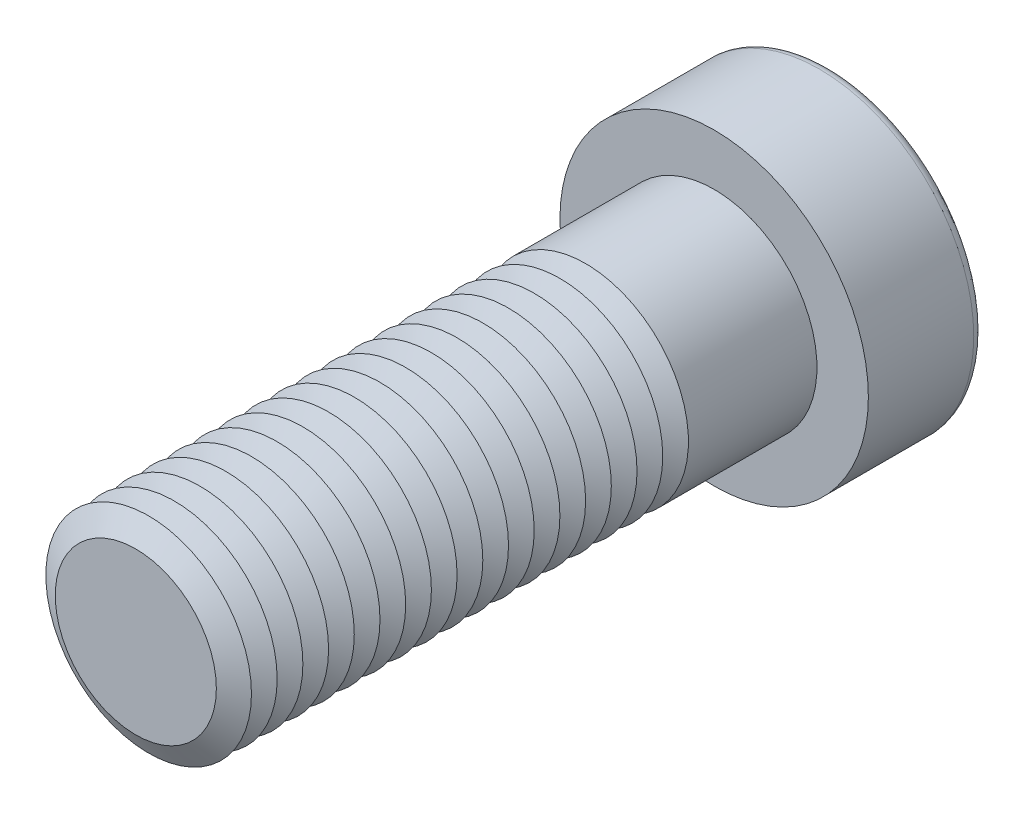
ISO-10303-21;
HEADER;
FILE_DESCRIPTION(('STEP AP214'),'2;1');
FILE_NAME('part.step','',(''),(''),'','','');
FILE_SCHEMA(('AUTOMOTIVE_DESIGN { 1 0 10303 214 1 1 1 1 }'));
ENDSEC;
DATA;
#1=APPLICATION_CONTEXT('core data for automotive mechanical design processes');
#2=APPLICATION_PROTOCOL_DEFINITION('international standard','automotive_design',2000,#1);
#3=PRODUCT_CONTEXT('',#1,'mechanical');
#4=PRODUCT('Part','Part','',(#3));
#5=PRODUCT_RELATED_PRODUCT_CATEGORY('part','',(#4));
#6=PRODUCT_DEFINITION_FORMATION('','',#4);
#7=PRODUCT_DEFINITION_CONTEXT('part definition',#1,'design');
#8=PRODUCT_DEFINITION('design','',#6,#7);
#9=PRODUCT_DEFINITION_SHAPE('','',#8);
#10=(LENGTH_UNIT() NAMED_UNIT(*) SI_UNIT(.MILLI.,.METRE.));
#11=(NAMED_UNIT(*) PLANE_ANGLE_UNIT() SI_UNIT($,.RADIAN.));
#12=(NAMED_UNIT(*) SI_UNIT($,.STERADIAN.) SOLID_ANGLE_UNIT());
#13=UNCERTAINTY_MEASURE_WITH_UNIT(LENGTH_MEASURE(1.E-05),#10,'distance_accuracy_value','');
#14=(GEOMETRIC_REPRESENTATION_CONTEXT(3) GLOBAL_UNCERTAINTY_ASSIGNED_CONTEXT((#13)) GLOBAL_UNIT_ASSIGNED_CONTEXT((#10,
#11,#12)) REPRESENTATION_CONTEXT('',''));
#15=CARTESIAN_POINT('',(0.,0.,0.));
#16=DIRECTION('',(0.,0.,1.));
#17=DIRECTION('',(1.,0.,0.));
#18=AXIS2_PLACEMENT_3D('',#15,#16,#17);
#19=CARTESIAN_POINT('',(0.,0.,38.));
#20=DIRECTION('',(0.,0.,1.));
#21=DIRECTION('',(1.,0.,0.));
#22=AXIS2_PLACEMENT_3D('',#19,#20,#21);
#23=CONICAL_SURFACE('',#22,8.,1.0471975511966);
#24=CARTESIAN_POINT('',(0.,0.,37.));
#25=DIRECTION('',(0.,0.,1.));
#26=DIRECTION('',(1.,0.,0.));
#27=AXIS2_PLACEMENT_3D('',#24,#25,#26);
#28=CIRCLE('',#27,6.26794919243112);
#29=CARTESIAN_POINT('',(6.26794919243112,0.,37.));
#30=VERTEX_POINT('',#29);
#31=EDGE_CURVE('E314',#30,#30,#28,.T.);
#32=ORIENTED_EDGE('',*,*,#31,.T.);
#33=EDGE_LOOP('',(#32));
#34=FACE_BOUND('',#33,.T.);
#35=CARTESIAN_POINT('',(0.,0.,38.));
#36=DIRECTION('',(0.,0.,1.));
#37=DIRECTION('',(1.,0.,0.));
#38=AXIS2_PLACEMENT_3D('',#35,#36,#37);
#39=CIRCLE('',#38,8.);
#40=CARTESIAN_POINT('',(8.,0.,38.));
#41=VERTEX_POINT('',#40);
#42=EDGE_CURVE('E317',#41,#41,#39,.T.);
#43=ORIENTED_EDGE('',*,*,#42,.F.);
#44=EDGE_LOOP('',(#43));
#45=FACE_BOUND('',#44,.T.);
#46=ADVANCED_FACE('F39',(#34,#45),#23,.T.);
#47=CARTESIAN_POINT('',(0.,0.,37.));
#48=DIRECTION('',(0.,0.,-1.));
#49=DIRECTION('',(-1.,0.,0.));
#50=AXIS2_PLACEMENT_3D('',#47,#48,#49);
#51=CONICAL_SURFACE('',#50,6.26794919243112,1.0471975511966);
#52=CARTESIAN_POINT('',(0.,0.,36.));
#53=DIRECTION('',(0.,0.,1.));
#54=DIRECTION('',(1.,0.,0.));
#55=AXIS2_PLACEMENT_3D('',#52,#53,#54);
#56=CIRCLE('',#55,8.);
#57=CARTESIAN_POINT('',(8.,0.,36.));
#58=VERTEX_POINT('',#57);
#59=EDGE_CURVE('E325',#58,#58,#56,.T.);
#60=ORIENTED_EDGE('',*,*,#59,.T.);
#61=EDGE_LOOP('',(#60));
#62=FACE_BOUND('',#61,.T.);
#63=ORIENTED_EDGE('',*,*,#31,.F.);
#64=EDGE_LOOP('',(#63));
#65=FACE_BOUND('',#64,.T.);
#66=ADVANCED_FACE('F245',(#62,#65),#51,.T.);
#67=CARTESIAN_POINT('',(0.,0.,45.));
#68=DIRECTION('',(0.,0.,1.));
#69=DIRECTION('',(1.,0.,0.));
#70=AXIS2_PLACEMENT_3D('',#67,#68,#69);
#71=PLANE('',#70);
#72=CARTESIAN_POINT('',(0.,0.,45.));
#73=DIRECTION('',(0.,0.,1.));
#74=DIRECTION('',(1.,0.,0.));
#75=AXIS2_PLACEMENT_3D('',#72,#73,#74);
#76=CIRCLE('',#75,6.26794919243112);
#77=CARTESIAN_POINT('',(6.26794919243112,0.,45.));
#78=VERTEX_POINT('',#77);
#79=EDGE_CURVE('E174',#78,#78,#76,.T.);
#80=ORIENTED_EDGE('',*,*,#79,.T.);
#81=EDGE_LOOP('',(#80));
#82=FACE_BOUND('',#81,.T.);
#83=ADVANCED_FACE('F251',(#82),#71,.T.);
#84=CARTESIAN_POINT('',(0.,0.,45.));
#85=DIRECTION('',(0.,0.,-1.));
#86=DIRECTION('',(-1.,0.,0.));
#87=AXIS2_PLACEMENT_3D('',#84,#85,#86);
#88=CONICAL_SURFACE('',#87,6.26794919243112,1.0471975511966);
#89=CARTESIAN_POINT('',(0.,0.,44.));
#90=DIRECTION('',(0.,0.,1.));
#91=DIRECTION('',(1.,0.,0.));
#92=AXIS2_PLACEMENT_3D('',#89,#90,#91);
#93=CIRCLE('',#92,8.);
#94=CARTESIAN_POINT('',(8.,0.,44.));
#95=VERTEX_POINT('',#94);
#96=EDGE_CURVE('E291',#95,#95,#93,.T.);
#97=ORIENTED_EDGE('',*,*,#96,.T.);
#98=EDGE_LOOP('',(#97));
#99=FACE_BOUND('',#98,.T.);
#100=ORIENTED_EDGE('',*,*,#79,.F.);
#101=EDGE_LOOP('',(#100));
#102=FACE_BOUND('',#101,.T.);
#103=ADVANCED_FACE('F199',(#99,#102),#88,.T.);
#104=CARTESIAN_POINT('',(0.,0.,44.));
#105=DIRECTION('',(0.,0.,1.));
#106=DIRECTION('',(1.,0.,0.));
#107=AXIS2_PLACEMENT_3D('',#104,#105,#106);
#108=CONICAL_SURFACE('',#107,8.,1.0471975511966);
#109=CARTESIAN_POINT('',(0.,0.,43.));
#110=DIRECTION('',(0.,0.,1.));
#111=DIRECTION('',(1.,0.,0.));
#112=AXIS2_PLACEMENT_3D('',#109,#110,#111);
#113=CIRCLE('',#112,6.26794919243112);
#114=CARTESIAN_POINT('',(6.26794919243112,0.,43.));
#115=VERTEX_POINT('',#114);
#116=EDGE_CURVE('E288',#115,#115,#113,.T.);
#117=ORIENTED_EDGE('',*,*,#116,.T.);
#118=EDGE_LOOP('',(#117));
#119=FACE_BOUND('',#118,.T.);
#120=ORIENTED_EDGE('',*,*,#96,.F.);
#121=EDGE_LOOP('',(#120));
#122=FACE_BOUND('',#121,.T.);
#123=ADVANCED_FACE('F277',(#119,#122),#108,.T.);
#124=CARTESIAN_POINT('',(0.,0.,43.));
#125=DIRECTION('',(0.,0.,-1.));
#126=DIRECTION('',(-1.,0.,0.));
#127=AXIS2_PLACEMENT_3D('',#124,#125,#126);
#128=CONICAL_SURFACE('',#127,6.26794919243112,1.0471975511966);
#129=CARTESIAN_POINT('',(0.,0.,42.));
#130=DIRECTION('',(0.,0.,1.));
#131=DIRECTION('',(1.,0.,0.));
#132=AXIS2_PLACEMENT_3D('',#129,#130,#131);
#133=CIRCLE('',#132,8.);
#134=CARTESIAN_POINT('',(8.,0.,42.));
#135=VERTEX_POINT('',#134);
#136=EDGE_CURVE('E300',#135,#135,#133,.T.);
#137=ORIENTED_EDGE('',*,*,#136,.T.);
#138=EDGE_LOOP('',(#137));
#139=FACE_BOUND('',#138,.T.);
#140=ORIENTED_EDGE('',*,*,#116,.F.);
#141=EDGE_LOOP('',(#140));
#142=FACE_BOUND('',#141,.T.);
#143=ADVANCED_FACE('F274',(#139,#142),#128,.T.);
#144=CARTESIAN_POINT('',(0.,0.,42.));
#145=DIRECTION('',(0.,0.,1.));
#146=DIRECTION('',(1.,0.,0.));
#147=AXIS2_PLACEMENT_3D('',#144,#145,#146);
#148=CONICAL_SURFACE('',#147,8.,1.0471975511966);
#149=CARTESIAN_POINT('',(0.,0.,41.));
#150=DIRECTION('',(0.,0.,1.));
#151=DIRECTION('',(1.,0.,0.));
#152=AXIS2_PLACEMENT_3D('',#149,#150,#151);
#153=CIRCLE('',#152,6.26794919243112);
#154=CARTESIAN_POINT('',(6.26794919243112,0.,41.));
#155=VERTEX_POINT('',#154);
#156=EDGE_CURVE('E293',#155,#155,#153,.T.);
#157=ORIENTED_EDGE('',*,*,#156,.T.);
#158=EDGE_LOOP('',(#157));
#159=FACE_BOUND('',#158,.T.);
#160=ORIENTED_EDGE('',*,*,#136,.F.);
#161=EDGE_LOOP('',(#160));
#162=FACE_BOUND('',#161,.T.);
#163=ADVANCED_FACE('F270',(#159,#162),#148,.T.);
#164=CARTESIAN_POINT('',(0.,0.,41.));
#165=DIRECTION('',(0.,0.,-1.));
#166=DIRECTION('',(-1.,0.,0.));
#167=AXIS2_PLACEMENT_3D('',#164,#165,#166);
#168=CONICAL_SURFACE('',#167,6.26794919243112,1.0471975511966);
#169=CARTESIAN_POINT('',(0.,0.,40.));
#170=DIRECTION('',(0.,0.,1.));
#171=DIRECTION('',(1.,0.,0.));
#172=AXIS2_PLACEMENT_3D('',#169,#170,#171);
#173=CIRCLE('',#172,8.);
#174=CARTESIAN_POINT('',(8.,0.,40.));
#175=VERTEX_POINT('',#174);
#176=EDGE_CURVE('E310',#175,#175,#173,.T.);
#177=ORIENTED_EDGE('',*,*,#176,.T.);
#178=EDGE_LOOP('',(#177));
#179=FACE_BOUND('',#178,.T.);
#180=ORIENTED_EDGE('',*,*,#156,.F.);
#181=EDGE_LOOP('',(#180));
#182=FACE_BOUND('',#181,.T.);
#183=ADVANCED_FACE('F266',(#179,#182),#168,.T.);
#184=CARTESIAN_POINT('',(0.,0.,40.));
#185=DIRECTION('',(0.,0.,1.));
#186=DIRECTION('',(1.,0.,0.));
#187=AXIS2_PLACEMENT_3D('',#184,#185,#186);
#188=CONICAL_SURFACE('',#187,8.,1.0471975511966);
#189=CARTESIAN_POINT('',(0.,0.,39.));
#190=DIRECTION('',(0.,0.,1.));
#191=DIRECTION('',(1.,0.,0.));
#192=AXIS2_PLACEMENT_3D('',#189,#190,#191);
#193=CIRCLE('',#192,6.26794919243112);
#194=CARTESIAN_POINT('',(6.26794919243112,0.,39.));
#195=VERTEX_POINT('',#194);
#196=EDGE_CURVE('E306',#195,#195,#193,.T.);
#197=ORIENTED_EDGE('',*,*,#196,.T.);
#198=EDGE_LOOP('',(#197));
#199=FACE_BOUND('',#198,.T.);
#200=ORIENTED_EDGE('',*,*,#176,.F.);
#201=EDGE_LOOP('',(#200));
#202=FACE_BOUND('',#201,.T.);
#203=ADVANCED_FACE('F262',(#199,#202),#188,.T.);
#204=CARTESIAN_POINT('',(0.,0.,39.));
#205=DIRECTION('',(0.,0.,-1.));
#206=DIRECTION('',(-1.,0.,0.));
#207=AXIS2_PLACEMENT_3D('',#204,#205,#206);
#208=CONICAL_SURFACE('',#207,6.26794919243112,1.0471975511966);
#209=ORIENTED_EDGE('',*,*,#42,.T.);
#210=EDGE_LOOP('',(#209));
#211=FACE_BOUND('',#210,.T.);
#212=ORIENTED_EDGE('',*,*,#196,.F.);
#213=EDGE_LOOP('',(#212));
#214=FACE_BOUND('',#213,.T.);
#215=ADVANCED_FACE('F258',(#211,#214),#208,.T.);
#216=CARTESIAN_POINT('',(0.,0.,36.));
#217=DIRECTION('',(0.,0.,1.));
#218=DIRECTION('',(1.,0.,0.));
#219=AXIS2_PLACEMENT_3D('',#216,#217,#218);
#220=CONICAL_SURFACE('',#219,8.,1.0471975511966);
#221=CARTESIAN_POINT('',(0.,0.,35.));
#222=DIRECTION('',(0.,0.,1.));
#223=DIRECTION('',(1.,0.,0.));
#224=AXIS2_PLACEMENT_3D('',#221,#222,#223);
#225=CIRCLE('',#224,6.26794919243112);
#226=CARTESIAN_POINT('',(6.26794919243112,0.,35.));
#227=VERTEX_POINT('',#226);
#228=EDGE_CURVE('E321',#227,#227,#225,.T.);
#229=ORIENTED_EDGE('',*,*,#228,.T.);
#230=EDGE_LOOP('',(#229));
#231=FACE_BOUND('',#230,.T.);
#232=ORIENTED_EDGE('',*,*,#59,.F.);
#233=EDGE_LOOP('',(#232));
#234=FACE_BOUND('',#233,.T.);
#235=ADVANCED_FACE('F261',(#231,#234),#220,.T.);
#236=CARTESIAN_POINT('',(0.,0.,35.));
#237=DIRECTION('',(0.,0.,-1.));
#238=DIRECTION('',(-1.,0.,0.));
#239=AXIS2_PLACEMENT_3D('',#236,#237,#238);
#240=CONICAL_SURFACE('',#239,6.26794919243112,1.0471975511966);
#241=CARTESIAN_POINT('',(0.,0.,34.));
#242=DIRECTION('',(0.,0.,1.));
#243=DIRECTION('',(1.,0.,0.));
#244=AXIS2_PLACEMENT_3D('',#241,#242,#243);
#245=CIRCLE('',#244,8.);
#246=CARTESIAN_POINT('',(8.,0.,34.));
#247=VERTEX_POINT('',#246);
#248=EDGE_CURVE('E333',#247,#247,#245,.T.);
#249=ORIENTED_EDGE('',*,*,#248,.T.);
#250=EDGE_LOOP('',(#249));
#251=FACE_BOUND('',#250,.T.);
#252=ORIENTED_EDGE('',*,*,#228,.F.);
#253=EDGE_LOOP('',(#252));
#254=FACE_BOUND('',#253,.T.);
#255=ADVANCED_FACE('F528',(#251,#254),#240,.T.);
#256=CARTESIAN_POINT('',(0.,0.,34.));
#257=DIRECTION('',(0.,0.,1.));
#258=DIRECTION('',(1.,0.,0.));
#259=AXIS2_PLACEMENT_3D('',#256,#257,#258);
#260=CONICAL_SURFACE('',#259,8.,1.0471975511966);
#261=CARTESIAN_POINT('',(0.,0.,33.));
#262=DIRECTION('',(0.,0.,1.));
#263=DIRECTION('',(1.,0.,0.));
#264=AXIS2_PLACEMENT_3D('',#261,#262,#263);
#265=CIRCLE('',#264,6.26794919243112);
#266=CARTESIAN_POINT('',(6.26794919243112,0.,33.));
#267=VERTEX_POINT('',#266);
#268=EDGE_CURVE('E329',#267,#267,#265,.T.);
#269=ORIENTED_EDGE('',*,*,#268,.T.);
#270=EDGE_LOOP('',(#269));
#271=FACE_BOUND('',#270,.T.);
#272=ORIENTED_EDGE('',*,*,#248,.F.);
#273=EDGE_LOOP('',(#272));
#274=FACE_BOUND('',#273,.T.);
#275=ADVANCED_FACE('F524',(#271,#274),#260,.T.);
#276=CARTESIAN_POINT('',(0.,0.,33.));
#277=DIRECTION('',(0.,0.,-1.));
#278=DIRECTION('',(-1.,0.,0.));
#279=AXIS2_PLACEMENT_3D('',#276,#277,#278);
#280=CONICAL_SURFACE('',#279,6.26794919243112,1.0471975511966);
#281=CARTESIAN_POINT('',(0.,0.,32.));
#282=DIRECTION('',(0.,0.,1.));
#283=DIRECTION('',(1.,0.,0.));
#284=AXIS2_PLACEMENT_3D('',#281,#282,#283);
#285=CIRCLE('',#284,8.);
#286=CARTESIAN_POINT('',(8.,0.,32.));
#287=VERTEX_POINT('',#286);
#288=EDGE_CURVE('E341',#287,#287,#285,.T.);
#289=ORIENTED_EDGE('',*,*,#288,.T.);
#290=EDGE_LOOP('',(#289));
#291=FACE_BOUND('',#290,.T.);
#292=ORIENTED_EDGE('',*,*,#268,.F.);
#293=EDGE_LOOP('',(#292));
#294=FACE_BOUND('',#293,.T.);
#295=ADVANCED_FACE('F520',(#291,#294),#280,.T.);
#296=CARTESIAN_POINT('',(0.,0.,32.));
#297=DIRECTION('',(0.,0.,1.));
#298=DIRECTION('',(1.,0.,0.));
#299=AXIS2_PLACEMENT_3D('',#296,#297,#298);
#300=CONICAL_SURFACE('',#299,8.,1.0471975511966);
#301=CARTESIAN_POINT('',(0.,0.,31.));
#302=DIRECTION('',(0.,0.,1.));
#303=DIRECTION('',(1.,0.,0.));
#304=AXIS2_PLACEMENT_3D('',#301,#302,#303);
#305=CIRCLE('',#304,6.26794919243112);
#306=CARTESIAN_POINT('',(6.26794919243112,0.,31.));
#307=VERTEX_POINT('',#306);
#308=EDGE_CURVE('E337',#307,#307,#305,.T.);
#309=ORIENTED_EDGE('',*,*,#308,.T.);
#310=EDGE_LOOP('',(#309));
#311=FACE_BOUND('',#310,.T.);
#312=ORIENTED_EDGE('',*,*,#288,.F.);
#313=EDGE_LOOP('',(#312));
#314=FACE_BOUND('',#313,.T.);
#315=ADVANCED_FACE('F516',(#311,#314),#300,.T.);
#316=CARTESIAN_POINT('',(0.,0.,31.));
#317=DIRECTION('',(0.,0.,-1.));
#318=DIRECTION('',(-1.,0.,0.));
#319=AXIS2_PLACEMENT_3D('',#316,#317,#318);
#320=CONICAL_SURFACE('',#319,6.26794919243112,1.0471975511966);
#321=CARTESIAN_POINT('',(0.,0.,30.));
#322=DIRECTION('',(0.,0.,1.));
#323=DIRECTION('',(1.,0.,0.));
#324=AXIS2_PLACEMENT_3D('',#321,#322,#323);
#325=CIRCLE('',#324,8.);
#326=CARTESIAN_POINT('',(8.,0.,30.));
#327=VERTEX_POINT('',#326);
#328=EDGE_CURVE('E349',#327,#327,#325,.T.);
#329=ORIENTED_EDGE('',*,*,#328,.T.);
#330=EDGE_LOOP('',(#329));
#331=FACE_BOUND('',#330,.T.);
#332=ORIENTED_EDGE('',*,*,#308,.F.);
#333=EDGE_LOOP('',(#332));
#334=FACE_BOUND('',#333,.T.);
#335=ADVANCED_FACE('F512',(#331,#334),#320,.T.);
#336=CARTESIAN_POINT('',(0.,0.,30.));
#337=DIRECTION('',(0.,0.,1.));
#338=DIRECTION('',(1.,0.,0.));
#339=AXIS2_PLACEMENT_3D('',#336,#337,#338);
#340=CONICAL_SURFACE('',#339,8.,1.0471975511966);
#341=CARTESIAN_POINT('',(0.,0.,29.));
#342=DIRECTION('',(0.,0.,1.));
#343=DIRECTION('',(1.,0.,0.));
#344=AXIS2_PLACEMENT_3D('',#341,#342,#343);
#345=CIRCLE('',#344,6.26794919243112);
#346=CARTESIAN_POINT('',(6.26794919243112,0.,29.));
#347=VERTEX_POINT('',#346);
#348=EDGE_CURVE('E345',#347,#347,#345,.T.);
#349=ORIENTED_EDGE('',*,*,#348,.T.);
#350=EDGE_LOOP('',(#349));
#351=FACE_BOUND('',#350,.T.);
#352=ORIENTED_EDGE('',*,*,#328,.F.);
#353=EDGE_LOOP('',(#352));
#354=FACE_BOUND('',#353,.T.);
#355=ADVANCED_FACE('F508',(#351,#354),#340,.T.);
#356=CARTESIAN_POINT('',(0.,0.,29.));
#357=DIRECTION('',(0.,0.,-1.));
#358=DIRECTION('',(-1.,0.,0.));
#359=AXIS2_PLACEMENT_3D('',#356,#357,#358);
#360=CONICAL_SURFACE('',#359,6.26794919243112,1.0471975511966);
#361=CARTESIAN_POINT('',(0.,0.,28.));
#362=DIRECTION('',(0.,0.,1.));
#363=DIRECTION('',(1.,0.,0.));
#364=AXIS2_PLACEMENT_3D('',#361,#362,#363);
#365=CIRCLE('',#364,8.);
#366=CARTESIAN_POINT('',(8.,0.,28.));
#367=VERTEX_POINT('',#366);
#368=EDGE_CURVE('E357',#367,#367,#365,.T.);
#369=ORIENTED_EDGE('',*,*,#368,.T.);
#370=EDGE_LOOP('',(#369));
#371=FACE_BOUND('',#370,.T.);
#372=ORIENTED_EDGE('',*,*,#348,.F.);
#373=EDGE_LOOP('',(#372));
#374=FACE_BOUND('',#373,.T.);
#375=ADVANCED_FACE('F504',(#371,#374),#360,.T.);
#376=CARTESIAN_POINT('',(0.,0.,28.));
#377=DIRECTION('',(0.,0.,1.));
#378=DIRECTION('',(1.,0.,0.));
#379=AXIS2_PLACEMENT_3D('',#376,#377,#378);
#380=CONICAL_SURFACE('',#379,8.,1.0471975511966);
#381=CARTESIAN_POINT('',(0.,0.,27.));
#382=DIRECTION('',(0.,0.,1.));
#383=DIRECTION('',(1.,0.,0.));
#384=AXIS2_PLACEMENT_3D('',#381,#382,#383);
#385=CIRCLE('',#384,6.26794919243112);
#386=CARTESIAN_POINT('',(6.26794919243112,0.,27.));
#387=VERTEX_POINT('',#386);
#388=EDGE_CURVE('E353',#387,#387,#385,.T.);
#389=ORIENTED_EDGE('',*,*,#388,.T.);
#390=EDGE_LOOP('',(#389));
#391=FACE_BOUND('',#390,.T.);
#392=ORIENTED_EDGE('',*,*,#368,.F.);
#393=EDGE_LOOP('',(#392));
#394=FACE_BOUND('',#393,.T.);
#395=ADVANCED_FACE('F500',(#391,#394),#380,.T.);
#396=CARTESIAN_POINT('',(0.,0.,27.));
#397=DIRECTION('',(0.,0.,-1.));
#398=DIRECTION('',(-1.,0.,0.));
#399=AXIS2_PLACEMENT_3D('',#396,#397,#398);
#400=CONICAL_SURFACE('',#399,6.26794919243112,1.0471975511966);
#401=CARTESIAN_POINT('',(0.,0.,26.));
#402=DIRECTION('',(0.,0.,1.));
#403=DIRECTION('',(1.,0.,0.));
#404=AXIS2_PLACEMENT_3D('',#401,#402,#403);
#405=CIRCLE('',#404,8.);
#406=CARTESIAN_POINT('',(8.,0.,26.));
#407=VERTEX_POINT('',#406);
#408=EDGE_CURVE('E365',#407,#407,#405,.T.);
#409=ORIENTED_EDGE('',*,*,#408,.T.);
#410=EDGE_LOOP('',(#409));
#411=FACE_BOUND('',#410,.T.);
#412=ORIENTED_EDGE('',*,*,#388,.F.);
#413=EDGE_LOOP('',(#412));
#414=FACE_BOUND('',#413,.T.);
#415=ADVANCED_FACE('F496',(#411,#414),#400,.T.);
#416=CARTESIAN_POINT('',(0.,0.,26.));
#417=DIRECTION('',(0.,0.,1.));
#418=DIRECTION('',(1.,0.,0.));
#419=AXIS2_PLACEMENT_3D('',#416,#417,#418);
#420=CONICAL_SURFACE('',#419,8.,1.0471975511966);
#421=CARTESIAN_POINT('',(0.,0.,25.));
#422=DIRECTION('',(0.,0.,1.));
#423=DIRECTION('',(1.,0.,0.));
#424=AXIS2_PLACEMENT_3D('',#421,#422,#423);
#425=CIRCLE('',#424,6.26794919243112);
#426=CARTESIAN_POINT('',(6.26794919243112,0.,25.));
#427=VERTEX_POINT('',#426);
#428=EDGE_CURVE('E361',#427,#427,#425,.T.);
#429=ORIENTED_EDGE('',*,*,#428,.T.);
#430=EDGE_LOOP('',(#429));
#431=FACE_BOUND('',#430,.T.);
#432=ORIENTED_EDGE('',*,*,#408,.F.);
#433=EDGE_LOOP('',(#432));
#434=FACE_BOUND('',#433,.T.);
#435=ADVANCED_FACE('F492',(#431,#434),#420,.T.);
#436=CARTESIAN_POINT('',(0.,0.,25.));
#437=DIRECTION('',(0.,0.,-1.));
#438=DIRECTION('',(-1.,0.,0.));
#439=AXIS2_PLACEMENT_3D('',#436,#437,#438);
#440=CONICAL_SURFACE('',#439,6.26794919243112,1.0471975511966);
#441=CARTESIAN_POINT('',(0.,0.,24.));
#442=DIRECTION('',(0.,0.,1.));
#443=DIRECTION('',(1.,0.,0.));
#444=AXIS2_PLACEMENT_3D('',#441,#442,#443);
#445=CIRCLE('',#444,8.);
#446=CARTESIAN_POINT('',(8.,0.,24.));
#447=VERTEX_POINT('',#446);
#448=EDGE_CURVE('E373',#447,#447,#445,.T.);
#449=ORIENTED_EDGE('',*,*,#448,.T.);
#450=EDGE_LOOP('',(#449));
#451=FACE_BOUND('',#450,.T.);
#452=ORIENTED_EDGE('',*,*,#428,.F.);
#453=EDGE_LOOP('',(#452));
#454=FACE_BOUND('',#453,.T.);
#455=ADVANCED_FACE('F488',(#451,#454),#440,.T.);
#456=CARTESIAN_POINT('',(0.,0.,24.));
#457=DIRECTION('',(0.,0.,1.));
#458=DIRECTION('',(1.,0.,0.));
#459=AXIS2_PLACEMENT_3D('',#456,#457,#458);
#460=CONICAL_SURFACE('',#459,8.,1.0471975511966);
#461=CARTESIAN_POINT('',(0.,0.,23.));
#462=DIRECTION('',(0.,0.,1.));
#463=DIRECTION('',(1.,0.,0.));
#464=AXIS2_PLACEMENT_3D('',#461,#462,#463);
#465=CIRCLE('',#464,6.26794919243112);
#466=CARTESIAN_POINT('',(6.26794919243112,0.,23.));
#467=VERTEX_POINT('',#466);
#468=EDGE_CURVE('E369',#467,#467,#465,.T.);
#469=ORIENTED_EDGE('',*,*,#468,.T.);
#470=EDGE_LOOP('',(#469));
#471=FACE_BOUND('',#470,.T.);
#472=ORIENTED_EDGE('',*,*,#448,.F.);
#473=EDGE_LOOP('',(#472));
#474=FACE_BOUND('',#473,.T.);
#475=ADVANCED_FACE('F484',(#471,#474),#460,.T.);
#476=CARTESIAN_POINT('',(0.,0.,23.));
#477=DIRECTION('',(0.,0.,-1.));
#478=DIRECTION('',(-1.,0.,0.));
#479=AXIS2_PLACEMENT_3D('',#476,#477,#478);
#480=CONICAL_SURFACE('',#479,6.26794919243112,1.0471975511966);
#481=CARTESIAN_POINT('',(0.,0.,22.));
#482=DIRECTION('',(0.,0.,1.));
#483=DIRECTION('',(1.,0.,0.));
#484=AXIS2_PLACEMENT_3D('',#481,#482,#483);
#485=CIRCLE('',#484,8.);
#486=CARTESIAN_POINT('',(8.,0.,22.));
#487=VERTEX_POINT('',#486);
#488=EDGE_CURVE('E380',#487,#487,#485,.T.);
#489=ORIENTED_EDGE('',*,*,#488,.T.);
#490=EDGE_LOOP('',(#489));
#491=FACE_BOUND('',#490,.T.);
#492=ORIENTED_EDGE('',*,*,#468,.F.);
#493=EDGE_LOOP('',(#492));
#494=FACE_BOUND('',#493,.T.);
#495=ADVANCED_FACE('F480',(#491,#494),#480,.T.);
#496=CARTESIAN_POINT('',(0.,0.,22.));
#497=DIRECTION('',(0.,0.,1.));
#498=DIRECTION('',(1.,0.,0.));
#499=AXIS2_PLACEMENT_3D('',#496,#497,#498);
#500=CONICAL_SURFACE('',#499,8.,1.0471975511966);
#501=CARTESIAN_POINT('',(0.,0.,21.));
#502=DIRECTION('',(0.,0.,1.));
#503=DIRECTION('',(1.,0.,0.));
#504=AXIS2_PLACEMENT_3D('',#501,#502,#503);
#505=CIRCLE('',#504,6.26794919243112);
#506=CARTESIAN_POINT('',(6.26794919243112,0.,21.));
#507=VERTEX_POINT('',#506);
#508=EDGE_CURVE('E377',#507,#507,#505,.T.);
#509=ORIENTED_EDGE('',*,*,#508,.T.);
#510=EDGE_LOOP('',(#509));
#511=FACE_BOUND('',#510,.T.);
#512=ORIENTED_EDGE('',*,*,#488,.F.);
#513=EDGE_LOOP('',(#512));
#514=FACE_BOUND('',#513,.T.);
#515=ADVANCED_FACE('F476',(#511,#514),#500,.T.);
#516=CARTESIAN_POINT('',(0.,0.,21.));
#517=DIRECTION('',(0.,0.,-1.));
#518=DIRECTION('',(-1.,0.,0.));
#519=AXIS2_PLACEMENT_3D('',#516,#517,#518);
#520=CONICAL_SURFACE('',#519,6.26794919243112,1.0471975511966);
#521=CARTESIAN_POINT('',(0.,0.,20.));
#522=DIRECTION('',(0.,0.,1.));
#523=DIRECTION('',(1.,0.,0.));
#524=AXIS2_PLACEMENT_3D('',#521,#522,#523);
#525=CIRCLE('',#524,8.);
#526=CARTESIAN_POINT('',(8.,0.,20.));
#527=VERTEX_POINT('',#526);
#528=EDGE_CURVE('E387',#527,#527,#525,.T.);
#529=ORIENTED_EDGE('',*,*,#528,.T.);
#530=EDGE_LOOP('',(#529));
#531=FACE_BOUND('',#530,.T.);
#532=ORIENTED_EDGE('',*,*,#508,.F.);
#533=EDGE_LOOP('',(#532));
#534=FACE_BOUND('',#533,.T.);
#535=ADVANCED_FACE('F472',(#531,#534),#520,.T.);
#536=CARTESIAN_POINT('',(0.,0.,20.));
#537=DIRECTION('',(0.,0.,1.));
#538=DIRECTION('',(1.,0.,0.));
#539=AXIS2_PLACEMENT_3D('',#536,#537,#538);
#540=CONICAL_SURFACE('',#539,8.,1.0471975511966);
#541=CARTESIAN_POINT('',(0.,0.,19.));
#542=DIRECTION('',(0.,0.,1.));
#543=DIRECTION('',(1.,0.,0.));
#544=AXIS2_PLACEMENT_3D('',#541,#542,#543);
#545=CIRCLE('',#544,6.26794919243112);
#546=CARTESIAN_POINT('',(6.26794919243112,0.,19.));
#547=VERTEX_POINT('',#546);
#548=EDGE_CURVE('E383',#547,#547,#545,.T.);
#549=ORIENTED_EDGE('',*,*,#548,.T.);
#550=EDGE_LOOP('',(#549));
#551=FACE_BOUND('',#550,.T.);
#552=ORIENTED_EDGE('',*,*,#528,.F.);
#553=EDGE_LOOP('',(#552));
#554=FACE_BOUND('',#553,.T.);
#555=ADVANCED_FACE('F468',(#551,#554),#540,.T.);
#556=CARTESIAN_POINT('',(0.,0.,19.));
#557=DIRECTION('',(0.,0.,-1.));
#558=DIRECTION('',(-1.,0.,0.));
#559=AXIS2_PLACEMENT_3D('',#556,#557,#558);
#560=CONICAL_SURFACE('',#559,6.26794919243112,1.0471975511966);
#561=CARTESIAN_POINT('',(0.,0.,18.));
#562=DIRECTION('',(0.,0.,1.));
#563=DIRECTION('',(1.,0.,0.));
#564=AXIS2_PLACEMENT_3D('',#561,#562,#563);
#565=CIRCLE('',#564,8.);
#566=CARTESIAN_POINT('',(8.,0.,18.));
#567=VERTEX_POINT('',#566);
#568=EDGE_CURVE('E395',#567,#567,#565,.T.);
#569=ORIENTED_EDGE('',*,*,#568,.T.);
#570=EDGE_LOOP('',(#569));
#571=FACE_BOUND('',#570,.T.);
#572=ORIENTED_EDGE('',*,*,#548,.F.);
#573=EDGE_LOOP('',(#572));
#574=FACE_BOUND('',#573,.T.);
#575=ADVANCED_FACE('F464',(#571,#574),#560,.T.);
#576=CARTESIAN_POINT('',(0.,0.,18.));
#577=DIRECTION('',(0.,0.,1.));
#578=DIRECTION('',(1.,0.,0.));
#579=AXIS2_PLACEMENT_3D('',#576,#577,#578);
#580=CONICAL_SURFACE('',#579,8.,1.0471975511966);
#581=CARTESIAN_POINT('',(0.,0.,17.));
#582=DIRECTION('',(0.,0.,1.));
#583=DIRECTION('',(1.,0.,0.));
#584=AXIS2_PLACEMENT_3D('',#581,#582,#583);
#585=CIRCLE('',#584,6.26794919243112);
#586=CARTESIAN_POINT('',(6.26794919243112,0.,17.));
#587=VERTEX_POINT('',#586);
#588=EDGE_CURVE('E391',#587,#587,#585,.T.);
#589=ORIENTED_EDGE('',*,*,#588,.T.);
#590=EDGE_LOOP('',(#589));
#591=FACE_BOUND('',#590,.T.);
#592=ORIENTED_EDGE('',*,*,#568,.F.);
#593=EDGE_LOOP('',(#592));
#594=FACE_BOUND('',#593,.T.);
#595=ADVANCED_FACE('F460',(#591,#594),#580,.T.);
#596=CARTESIAN_POINT('',(0.,0.,17.));
#597=DIRECTION('',(0.,0.,-1.));
#598=DIRECTION('',(-1.,0.,0.));
#599=AXIS2_PLACEMENT_3D('',#596,#597,#598);
#600=CONICAL_SURFACE('',#599,6.26794919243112,1.0471975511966);
#601=CARTESIAN_POINT('',(0.,0.,16.));
#602=DIRECTION('',(0.,0.,1.));
#603=DIRECTION('',(1.,0.,0.));
#604=AXIS2_PLACEMENT_3D('',#601,#602,#603);
#605=CIRCLE('',#604,8.);
#606=CARTESIAN_POINT('',(8.,0.,16.));
#607=VERTEX_POINT('',#606);
#608=EDGE_CURVE('E403',#607,#607,#605,.T.);
#609=ORIENTED_EDGE('',*,*,#608,.T.);
#610=EDGE_LOOP('',(#609));
#611=FACE_BOUND('',#610,.T.);
#612=ORIENTED_EDGE('',*,*,#588,.F.);
#613=EDGE_LOOP('',(#612));
#614=FACE_BOUND('',#613,.T.);
#615=ADVANCED_FACE('F456',(#611,#614),#600,.T.);
#616=CARTESIAN_POINT('',(0.,0.,16.));
#617=DIRECTION('',(0.,0.,1.));
#618=DIRECTION('',(1.,0.,0.));
#619=AXIS2_PLACEMENT_3D('',#616,#617,#618);
#620=CONICAL_SURFACE('',#619,8.,1.0471975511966);
#621=CARTESIAN_POINT('',(0.,0.,15.));
#622=DIRECTION('',(0.,0.,1.));
#623=DIRECTION('',(1.,0.,0.));
#624=AXIS2_PLACEMENT_3D('',#621,#622,#623);
#625=CIRCLE('',#624,6.26794919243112);
#626=CARTESIAN_POINT('',(6.26794919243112,0.,15.));
#627=VERTEX_POINT('',#626);
#628=EDGE_CURVE('E399',#627,#627,#625,.T.);
#629=ORIENTED_EDGE('',*,*,#628,.T.);
#630=EDGE_LOOP('',(#629));
#631=FACE_BOUND('',#630,.T.);
#632=ORIENTED_EDGE('',*,*,#608,.F.);
#633=EDGE_LOOP('',(#632));
#634=FACE_BOUND('',#633,.T.);
#635=ADVANCED_FACE('F452',(#631,#634),#620,.T.);
#636=CARTESIAN_POINT('',(0.,0.,15.));
#637=DIRECTION('',(0.,0.,-1.));
#638=DIRECTION('',(-1.,0.,0.));
#639=AXIS2_PLACEMENT_3D('',#636,#637,#638);
#640=CONICAL_SURFACE('',#639,6.26794919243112,1.0471975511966);
#641=CARTESIAN_POINT('',(0.,0.,14.));
#642=DIRECTION('',(0.,0.,1.));
#643=DIRECTION('',(1.,0.,0.));
#644=AXIS2_PLACEMENT_3D('',#641,#642,#643);
#645=CIRCLE('',#644,8.);
#646=CARTESIAN_POINT('',(8.,0.,14.));
#647=VERTEX_POINT('',#646);
#648=EDGE_CURVE('E411',#647,#647,#645,.T.);
#649=ORIENTED_EDGE('',*,*,#648,.T.);
#650=EDGE_LOOP('',(#649));
#651=FACE_BOUND('',#650,.T.);
#652=ORIENTED_EDGE('',*,*,#628,.F.);
#653=EDGE_LOOP('',(#652));
#654=FACE_BOUND('',#653,.T.);
#655=ADVANCED_FACE('F448',(#651,#654),#640,.T.);
#656=CARTESIAN_POINT('',(0.,0.,14.));
#657=DIRECTION('',(0.,0.,1.));
#658=DIRECTION('',(1.,0.,0.));
#659=AXIS2_PLACEMENT_3D('',#656,#657,#658);
#660=CONICAL_SURFACE('',#659,8.,1.0471975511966);
#661=CARTESIAN_POINT('',(0.,0.,13.));
#662=DIRECTION('',(0.,0.,1.));
#663=DIRECTION('',(1.,0.,0.));
#664=AXIS2_PLACEMENT_3D('',#661,#662,#663);
#665=CIRCLE('',#664,6.26794919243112);
#666=CARTESIAN_POINT('',(6.26794919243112,0.,13.));
#667=VERTEX_POINT('',#666);
#668=EDGE_CURVE('E407',#667,#667,#665,.T.);
#669=ORIENTED_EDGE('',*,*,#668,.T.);
#670=EDGE_LOOP('',(#669));
#671=FACE_BOUND('',#670,.T.);
#672=ORIENTED_EDGE('',*,*,#648,.F.);
#673=EDGE_LOOP('',(#672));
#674=FACE_BOUND('',#673,.T.);
#675=ADVANCED_FACE('F443',(#671,#674),#660,.T.);
#676=CARTESIAN_POINT('',(0.,0.,13.));
#677=DIRECTION('',(0.,0.,-1.));
#678=DIRECTION('',(-1.,0.,0.));
#679=AXIS2_PLACEMENT_3D('',#676,#677,#678);
#680=CONICAL_SURFACE('',#679,6.26794919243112,1.0471975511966);
#681=CARTESIAN_POINT('',(0.,0.,12.));
#682=DIRECTION('',(0.,0.,1.));
#683=DIRECTION('',(1.,0.,0.));
#684=AXIS2_PLACEMENT_3D('',#681,#682,#683);
#685=CIRCLE('',#684,8.);
#686=CARTESIAN_POINT('',(8.,0.,12.));
#687=VERTEX_POINT('',#686);
#688=EDGE_CURVE('E423',#687,#687,#685,.T.);
#689=ORIENTED_EDGE('',*,*,#688,.T.);
#690=EDGE_LOOP('',(#689));
#691=FACE_BOUND('',#690,.T.);
#692=ORIENTED_EDGE('',*,*,#668,.F.);
#693=EDGE_LOOP('',(#692));
#694=FACE_BOUND('',#693,.T.);
#695=ADVANCED_FACE('F429',(#691,#694),#680,.T.);
#696=CARTESIAN_POINT('',(0.,0.,12.));
#697=DIRECTION('',(0.,0.,1.));
#698=DIRECTION('',(1.,0.,0.));
#699=AXIS2_PLACEMENT_3D('',#696,#697,#698);
#700=CONICAL_SURFACE('',#699,8.,1.0471975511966);
#701=CARTESIAN_POINT('',(0.,0.,11.));
#702=DIRECTION('',(0.,0.,1.));
#703=DIRECTION('',(1.,0.,0.));
#704=AXIS2_PLACEMENT_3D('',#701,#702,#703);
#705=CIRCLE('',#704,6.26794919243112);
#706=CARTESIAN_POINT('',(6.26794919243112,0.,11.));
#707=VERTEX_POINT('',#706);
#708=EDGE_CURVE('E415',#707,#707,#705,.T.);
#709=ORIENTED_EDGE('',*,*,#708,.T.);
#710=EDGE_LOOP('',(#709));
#711=FACE_BOUND('',#710,.T.);
#712=ORIENTED_EDGE('',*,*,#688,.F.);
#713=EDGE_LOOP('',(#712));
#714=FACE_BOUND('',#713,.T.);
#715=ADVANCED_FACE('F432',(#711,#714),#700,.T.);
#716=CARTESIAN_POINT('',(0.,0.,11.));
#717=DIRECTION('',(0.,0.,-1.));
#718=DIRECTION('',(-1.,0.,0.));
#719=AXIS2_PLACEMENT_3D('',#716,#717,#718);
#720=CONICAL_SURFACE('',#719,6.26794919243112,1.0471975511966);
#721=CARTESIAN_POINT('',(0.,0.,9.99999999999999));
#722=DIRECTION('',(0.,0.,1.));
#723=DIRECTION('',(1.,0.,0.));
#724=AXIS2_PLACEMENT_3D('',#721,#722,#723);
#725=CIRCLE('',#724,8.);
#726=CARTESIAN_POINT('',(-8.,0.,9.99999999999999));
#727=VERTEX_POINT('',#726);
#728=EDGE_CURVE('E419',#727,#727,#725,.T.);
#729=ORIENTED_EDGE('',*,*,#728,.T.);
#730=EDGE_LOOP('',(#729));
#731=FACE_BOUND('',#730,.T.);
#732=ORIENTED_EDGE('',*,*,#708,.F.);
#733=EDGE_LOOP('',(#732));
#734=FACE_BOUND('',#733,.T.);
#735=ADVANCED_FACE('F434',(#731,#734),#720,.T.);
#736=CARTESIAN_POINT('',(0.,0.,0.));
#737=DIRECTION('',(0.,0.,-1.));
#738=DIRECTION('',(-1.,0.,0.));
#739=AXIS2_PLACEMENT_3D('',#736,#737,#738);
#740=CONICAL_SURFACE('',#739,6.,1.0471975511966);
#741=CARTESIAN_POINT('',(0.,0.,3.46410161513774));
#742=VERTEX_POINT('',#741);
#743=VERTEX_LOOP('',#742);
#744=FACE_BOUND('',#743,.T.);
#745=CARTESIAN_POINT('',(0.,0.,0.));
#746=DIRECTION('',(0.,0.,-1.));
#747=DIRECTION('',(-1.,0.,0.));
#748=AXIS2_PLACEMENT_3D('',#745,#746,#747);
#749=CIRCLE('',#748,6.);
#750=CARTESIAN_POINT('',(-5.19615242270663,3.,0.));
#751=VERTEX_POINT('',#750);
#752=CARTESIAN_POINT('',(0.,6.,0.));
#753=VERTEX_POINT('',#752);
#754=EDGE_CURVE('E149',#751,#753,#749,.T.);
#755=ORIENTED_EDGE('',*,*,#754,.T.);
#756=CARTESIAN_POINT('',(0.,0.,0.));
#757=DIRECTION('',(0.,0.,-1.));
#758=DIRECTION('',(-1.,0.,0.));
#759=AXIS2_PLACEMENT_3D('',#756,#757,#758);
#760=CIRCLE('',#759,6.);
#761=CARTESIAN_POINT('',(5.19615242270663,3.,0.));
#762=VERTEX_POINT('',#761);
#763=EDGE_CURVE('E54',#753,#762,#760,.T.);
#764=ORIENTED_EDGE('',*,*,#763,.T.);
#765=CARTESIAN_POINT('',(5.19615242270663,-3.,0.));
#766=VERTEX_POINT('',#765);
#767=EDGE_CURVE('E1056',#762,#766,#760,.T.);
#768=ORIENTED_EDGE('',*,*,#767,.T.);
#769=CARTESIAN_POINT('',(0.,-6.,0.));
#770=VERTEX_POINT('',#769);
#771=EDGE_CURVE('E1055',#766,#770,#760,.T.);
#772=ORIENTED_EDGE('',*,*,#771,.T.);
#773=CARTESIAN_POINT('',(-5.19615242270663,-3.,0.));
#774=VERTEX_POINT('',#773);
#775=EDGE_CURVE('E1050',#770,#774,#760,.T.);
#776=ORIENTED_EDGE('',*,*,#775,.T.);
#777=EDGE_CURVE('E1049',#774,#751,#760,.T.);
#778=ORIENTED_EDGE('',*,*,#777,.T.);
#779=EDGE_LOOP('',(#755,#764,#768,#772,#776,#778));
#780=FACE_BOUND('',#779,.T.);
#781=ADVANCED_FACE('F201',(#744,#780),#740,.F.);
#782=CARTESIAN_POINT('',(0.,0.,0.));
#783=DIRECTION('',(0.,0.,-1.));
#784=DIRECTION('',(-1.,0.,0.));
#785=AXIS2_PLACEMENT_3D('',#782,#783,#784);
#786=PLANE('',#785);
#787=ORIENTED_EDGE('',*,*,#763,.F.);
#788=DIRECTION('',(1.,0.,0.));
#789=VECTOR('',#788,1.);
#790=CARTESIAN_POINT('',(-3.46410161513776,6.,0.));
#791=LINE('',#790,#789);
#792=CARTESIAN_POINT('',(3.46410161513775,6.,0.));
#793=VERTEX_POINT('',#792);
#794=EDGE_CURVE('E1102',#753,#793,#791,.T.);
#795=ORIENTED_EDGE('',*,*,#794,.T.);
#796=DIRECTION('',(0.5,-0.866025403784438,0.));
#797=VECTOR('',#796,1.);
#798=CARTESIAN_POINT('',(3.46410161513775,6.,0.));
#799=LINE('',#798,#797);
#800=EDGE_CURVE('E155',#793,#762,#799,.T.);
#801=ORIENTED_EDGE('',*,*,#800,.T.);
#802=EDGE_LOOP('',(#787,#795,#801));
#803=FACE_BOUND('',#802,.T.);
#804=ADVANCED_FACE('F629',(#803),#786,.T.);
#805=ORIENTED_EDGE('',*,*,#767,.F.);
#806=CARTESIAN_POINT('',(6.92820323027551,0.,0.));
#807=VERTEX_POINT('',#806);
#808=EDGE_CURVE('E1097',#762,#807,#799,.T.);
#809=ORIENTED_EDGE('',*,*,#808,.T.);
#810=DIRECTION('',(-0.5,-0.866025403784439,0.));
#811=VECTOR('',#810,1.);
#812=CARTESIAN_POINT('',(6.92820323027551,0.,0.));
#813=LINE('',#812,#811);
#814=EDGE_CURVE('E1069',#807,#766,#813,.T.);
#815=ORIENTED_EDGE('',*,*,#814,.T.);
#816=EDGE_LOOP('',(#805,#809,#815));
#817=FACE_BOUND('',#816,.T.);
#818=ADVANCED_FACE('F639',(#817),#786,.T.);
#819=ORIENTED_EDGE('',*,*,#771,.F.);
#820=CARTESIAN_POINT('',(3.46410161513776,-6.,0.));
#821=VERTEX_POINT('',#820);
#822=EDGE_CURVE('E1071',#766,#821,#813,.T.);
#823=ORIENTED_EDGE('',*,*,#822,.T.);
#824=DIRECTION('',(-1.,0.,0.));
#825=VECTOR('',#824,1.);
#826=CARTESIAN_POINT('',(3.46410161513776,-6.,0.));
#827=LINE('',#826,#825);
#828=EDGE_CURVE('E1022',#821,#770,#827,.T.);
#829=ORIENTED_EDGE('',*,*,#828,.T.);
#830=EDGE_LOOP('',(#819,#823,#829));
#831=FACE_BOUND('',#830,.T.);
#832=ADVANCED_FACE('F649',(#831),#786,.T.);
#833=ORIENTED_EDGE('',*,*,#775,.F.);
#834=CARTESIAN_POINT('',(-3.46410161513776,-6.,0.));
#835=VERTEX_POINT('',#834);
#836=EDGE_CURVE('E1066',#770,#835,#827,.T.);
#837=ORIENTED_EDGE('',*,*,#836,.T.);
#838=DIRECTION('',(-0.5,0.866025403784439,0.));
#839=VECTOR('',#838,1.);
#840=CARTESIAN_POINT('',(-3.46410161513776,-6.,0.));
#841=LINE('',#840,#839);
#842=EDGE_CURVE('E1068',#835,#774,#841,.T.);
#843=ORIENTED_EDGE('',*,*,#842,.T.);
#844=EDGE_LOOP('',(#833,#837,#843));
#845=FACE_BOUND('',#844,.T.);
#846=ADVANCED_FACE('F657',(#845),#786,.T.);
#847=ORIENTED_EDGE('',*,*,#777,.F.);
#848=CARTESIAN_POINT('',(-6.92820323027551,0.,0.));
#849=VERTEX_POINT('',#848);
#850=EDGE_CURVE('E1073',#774,#849,#841,.T.);
#851=ORIENTED_EDGE('',*,*,#850,.T.);
#852=DIRECTION('',(0.5,0.866025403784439,0.));
#853=VECTOR('',#852,1.);
#854=CARTESIAN_POINT('',(-6.92820323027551,0.,0.));
#855=LINE('',#854,#853);
#856=EDGE_CURVE('E158',#849,#751,#855,.T.);
#857=ORIENTED_EDGE('',*,*,#856,.T.);
#858=EDGE_LOOP('',(#847,#851,#857));
#859=FACE_BOUND('',#858,.T.);
#860=ADVANCED_FACE('F231',(#859),#786,.T.);
#861=ORIENTED_EDGE('',*,*,#754,.F.);
#862=CARTESIAN_POINT('',(-3.46410161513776,6.,0.));
#863=VERTEX_POINT('',#862);
#864=EDGE_CURVE('E1081',#751,#863,#855,.T.);
#865=ORIENTED_EDGE('',*,*,#864,.T.);
#866=EDGE_CURVE('E1099',#863,#753,#791,.T.);
#867=ORIENTED_EDGE('',*,*,#866,.T.);
#868=EDGE_LOOP('',(#861,#865,#867));
#869=FACE_BOUND('',#868,.T.);
#870=ADVANCED_FACE('F641',(#869),#786,.T.);
#871=CARTESIAN_POINT('',(-3.46410161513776,6.,0.));
#872=DIRECTION('',(0.,1.,0.));
#873=DIRECTION('',(0.,0.,1.));
#874=AXIS2_PLACEMENT_3D('',#871,#872,#873);
#875=PLANE('',#874);
#876=DIRECTION('',(0.,0.,-1.));
#877=VECTOR('',#876,1.);
#878=CARTESIAN_POINT('',(-3.46410161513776,6.,0.));
#879=LINE('',#878,#877);
#880=CARTESIAN_POINT('',(-3.46410161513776,6.,-9.));
#881=VERTEX_POINT('',#880);
#882=EDGE_CURVE('E147',#863,#881,#879,.T.);
#883=ORIENTED_EDGE('',*,*,#882,.T.);
#884=CARTESIAN_POINT('',(-9.04322275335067,6.,-10.0515506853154));
#885=CARTESIAN_POINT('',(-8.77229389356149,6.,-9.99107568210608));
#886=CARTESIAN_POINT('',(-8.50119215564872,6.,-9.93136093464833));
#887=CARTESIAN_POINT('',(-7.95855825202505,6.,-9.81386229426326));
#888=CARTESIAN_POINT('',(-7.68702606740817,6.,-9.75607848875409));
#889=CARTESIAN_POINT('',(-7.14318995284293,6.,-9.64279905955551));
#890=CARTESIAN_POINT('',(-6.87088551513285,6.,-9.58730586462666));
#891=CARTESIAN_POINT('',(-6.32570082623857,6.,-9.47922577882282));
#892=CARTESIAN_POINT('',(-6.05282058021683,6.,-9.42663886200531));
#893=CARTESIAN_POINT('',(-5.50875458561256,6.,-9.32550177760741));
#894=CARTESIAN_POINT('',(-5.23757463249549,6.,-9.27692059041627));
#895=CARTESIAN_POINT('',(-4.69446863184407,6.,-9.18413302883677));
#896=CARTESIAN_POINT('',(-4.42254260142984,6.,-9.13992655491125));
#897=CARTESIAN_POINT('',(-3.87790333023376,6.,-9.05690830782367));
#898=CARTESIAN_POINT('',(-3.6051902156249,6.,-9.0180957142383));
#899=CARTESIAN_POINT('',(-3.05890080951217,6.,-8.94703062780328));
#900=CARTESIAN_POINT('',(-2.7853245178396,6.,-8.91477813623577));
#901=CARTESIAN_POINT('',(-2.23425545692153,6.,-8.85776959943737));
#902=CARTESIAN_POINT('',(-1.95675335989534,6.,-8.83310236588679));
#903=CARTESIAN_POINT('',(-1.40107824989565,6.,-8.79298360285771));
#904=CARTESIAN_POINT('',(-1.12290525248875,6.,-8.77753186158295));
#905=CARTESIAN_POINT('',(-0.566293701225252,6.,-8.75674610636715));
#906=CARTESIAN_POINT('',(-0.28785531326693,6.,-8.75140773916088));
#907=CARTESIAN_POINT('',(0.269026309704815,6.,-8.75117360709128));
#908=CARTESIAN_POINT('',(0.547469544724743,6.,-8.75627785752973));
#909=CARTESIAN_POINT('',(1.10511819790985,6.,-8.77664719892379));
#910=CARTESIAN_POINT('',(1.38432206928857,6.,-8.79195380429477));
#911=CARTESIAN_POINT('',(1.94205759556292,6.,-8.83187108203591));
#912=CARTESIAN_POINT('',(2.22058923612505,6.,-8.85648195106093));
#913=CARTESIAN_POINT('',(2.77698779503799,6.,-8.91379497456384));
#914=CARTESIAN_POINT('',(3.0548541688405,6.,-8.94650233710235));
#915=CARTESIAN_POINT('',(3.60969614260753,6.,-9.01868375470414));
#916=CARTESIAN_POINT('',(3.8866717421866,6.,-9.0581578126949));
#917=CARTESIAN_POINT('',(4.44700464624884,6.,-9.14374886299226));
#918=CARTESIAN_POINT('',(4.73033933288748,6.,-9.190012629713));
#919=CARTESIAN_POINT('',(5.29620685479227,6.,-9.28723184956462));
#920=CARTESIAN_POINT('',(5.57873966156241,6.,-9.3381874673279));
#921=CARTESIAN_POINT('',(6.14313105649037,6.,-9.44386031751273));
#922=CARTESIAN_POINT('',(6.42498956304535,6.,-9.49857798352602));
#923=CARTESIAN_POINT('',(6.98810511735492,6.,-9.61103289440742));
#924=CARTESIAN_POINT('',(7.26936215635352,6.,-9.66877018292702));
#925=CARTESIAN_POINT('',(8.11254995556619,6.,-9.84563705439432));
#926=CARTESIAN_POINT('',(8.67372006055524,6.,-9.96838761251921));
#927=CARTESIAN_POINT('',(9.79457370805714,6.,-10.2202420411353));
#928=CARTESIAN_POINT('',(10.3542573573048,6.,-10.3493454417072));
#929=CARTESIAN_POINT('',(11.4657945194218,6.,-10.6103395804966));
#930=CARTESIAN_POINT('',(12.0176605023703,6.,-10.7421773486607));
#931=CARTESIAN_POINT('',(13.1206665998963,6.,-11.0089002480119));
#932=CARTESIAN_POINT('',(13.6718066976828,6.,-11.1437854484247));
#933=CARTESIAN_POINT('',(14.7727697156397,6.,-11.4155878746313));
#934=CARTESIAN_POINT('',(15.3225934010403,6.,-11.5525020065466));
#935=CARTESIAN_POINT('',(16.4217957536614,6.,-11.8280226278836));
#936=CARTESIAN_POINT('',(16.971174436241,6.,-11.9666290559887));
#937=CARTESIAN_POINT('',(17.5204019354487,6.,-12.1058251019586));
#938=B_SPLINE_CURVE_WITH_KNOTS('',3,(#884,#885,#886,#887,#888,#889,#890,#891,#892,#893,#894,
#895,#896,#897,#898,#899,#900,#901,#902,#903,#904,#905,#906,#907,#908,#909,#910,#911,#912,#913,
#914,#915,#916,#917,#918,#919,#920,#921,#922,#923,#924,#925,#926,#927,#928,#929,#930,#931,#932,
#933,#934,#935,#936,#937),.UNSPECIFIED.,.F.,.F.,(4,2,2,2,2,2,2,2,2,2,2,2,2,2,2,2,2,2,2,2,2,2,2,
2,2,2,4),(0.,0.832792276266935,1.6656222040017,2.49931362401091,3.33299760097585,
4.15946050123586,4.98590459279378,5.81222284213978,6.63854125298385,7.47419540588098,
8.30983035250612,9.14510552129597,9.98038191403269,10.8190780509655,11.6577919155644,
12.4970466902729,13.336301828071,14.1975135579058,15.0587555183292,15.9200969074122,
16.7814507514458,18.5047000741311,20.2278221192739,21.929995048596,23.6322066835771,
25.3320460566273,27.0318240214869),.UNSPECIFIED.);
#939=CARTESIAN_POINT('',(3.46410161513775,6.,-9.));
#940=VERTEX_POINT('',#939);
#941=EDGE_CURVE('E124',#881,#940,#938,.T.);
#942=ORIENTED_EDGE('',*,*,#941,.T.);
#943=DIRECTION('',(0.,0.,-1.));
#944=VECTOR('',#943,1.);
#945=CARTESIAN_POINT('',(3.46410161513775,6.,0.));
#946=LINE('',#945,#944);
#947=EDGE_CURVE('E143',#793,#940,#946,.T.);
#948=ORIENTED_EDGE('',*,*,#947,.F.);
#949=ORIENTED_EDGE('',*,*,#794,.F.);
#950=ORIENTED_EDGE('',*,*,#866,.F.);
#951=EDGE_LOOP('',(#883,#942,#948,#949,#950));
#952=FACE_BOUND('',#951,.T.);
#953=ADVANCED_FACE('F141',(#952),#875,.F.);
#954=CARTESIAN_POINT('',(3.46410161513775,6.,0.));
#955=DIRECTION('',(0.866025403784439,0.5,0.));
#956=DIRECTION('',(-0.5,0.866025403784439,0.));
#957=AXIS2_PLACEMENT_3D('',#954,#955,#956);
#958=PLANE('',#957);
#959=ORIENTED_EDGE('',*,*,#947,.T.);
#960=CARTESIAN_POINT('',(3.46398614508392,6.0002,-9.00003094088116));
#961=CARTESIAN_POINT('',(3.60785114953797,5.75101850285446,-8.96146591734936));
#962=CARTESIAN_POINT('',(3.75197700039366,5.5013852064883,-8.92645521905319));
#963=CARTESIAN_POINT('',(4.0407377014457,5.00123700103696,-8.86494467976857));
#964=CARTESIAN_POINT('',(4.18537273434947,4.75072177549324,-8.83844829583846));
#965=CARTESIAN_POINT('',(4.47427486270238,4.25032861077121,-8.79551324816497));
#966=CARTESIAN_POINT('',(4.61854000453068,4.00045405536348,-8.77902338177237));
#967=CARTESIAN_POINT('',(4.90725426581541,3.5003862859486,-8.75691215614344));
#968=CARTESIAN_POINT('',(5.05170334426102,3.2501931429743,-8.75128869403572));
#969=CARTESIAN_POINT('',(5.34060150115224,2.7498068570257,-8.75128869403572));
#970=CARTESIAN_POINT('',(5.48505057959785,2.49961371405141,-8.75691215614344));
#971=CARTESIAN_POINT('',(5.77376484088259,1.99954594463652,-8.77902338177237));
#972=CARTESIAN_POINT('',(5.91802998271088,1.74967138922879,-8.79551324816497));
#973=CARTESIAN_POINT('',(6.20693211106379,1.24927822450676,-8.83844829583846));
#974=CARTESIAN_POINT('',(6.35156714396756,0.998762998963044,-8.86494467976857));
#975=CARTESIAN_POINT('',(6.6403278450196,0.498614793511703,-8.92645521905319));
#976=CARTESIAN_POINT('',(6.78445369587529,0.248981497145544,-8.96146591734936));
#977=CARTESIAN_POINT('',(6.92831870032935,-0.000199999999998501,-9.00003094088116));
#978=B_SPLINE_CURVE_WITH_KNOTS('',3,(#960,#961,#962,#963,#964,#965,#966,#967,#968,#969,#970,
#971,#972,#973,#974,#975,#976,#977),.UNSPECIFIED.,.F.,.F.,(4,2,2,2,2,2,2,2,4),(0.,
0.870954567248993,1.74226232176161,2.60907321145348,3.47571633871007,4.34235946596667,
5.20917035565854,6.08047811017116,6.95143267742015),.UNSPECIFIED.);
#979=CARTESIAN_POINT('',(6.92820323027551,0.,-9.));
#980=VERTEX_POINT('',#979);
#981=EDGE_CURVE('E11',#940,#980,#978,.T.);
#982=ORIENTED_EDGE('',*,*,#981,.T.);
#983=DIRECTION('',(0.,0.,-1.));
#984=VECTOR('',#983,1.);
#985=CARTESIAN_POINT('',(6.92820323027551,0.,0.));
#986=LINE('',#985,#984);
#987=EDGE_CURVE('E157',#807,#980,#986,.T.);
#988=ORIENTED_EDGE('',*,*,#987,.F.);
#989=ORIENTED_EDGE('',*,*,#808,.F.);
#990=ORIENTED_EDGE('',*,*,#800,.F.);
#991=EDGE_LOOP('',(#959,#982,#988,#989,#990));
#992=FACE_BOUND('',#991,.T.);
#993=ADVANCED_FACE('F152',(#992),#958,.F.);
#994=CARTESIAN_POINT('',(6.92820323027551,0.,0.));
#995=DIRECTION('',(0.866025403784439,-0.5,0.));
#996=DIRECTION('',(0.5,0.866025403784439,0.));
#997=AXIS2_PLACEMENT_3D('',#994,#995,#996);
#998=PLANE('',#997);
#999=ORIENTED_EDGE('',*,*,#987,.T.);
#1000=CARTESIAN_POINT('',(6.92831870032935,0.000200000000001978,-9.00003094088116));
#1001=CARTESIAN_POINT('',(6.78445369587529,-0.24898149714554,-8.96146591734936));
#1002=CARTESIAN_POINT('',(6.6403278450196,-0.498614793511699,-8.92645521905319));
#1003=CARTESIAN_POINT('',(6.35156714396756,-0.99876299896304,-8.86494467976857));
#1004=CARTESIAN_POINT('',(6.20693211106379,-1.24927822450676,-8.83844829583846));
#1005=CARTESIAN_POINT('',(5.91802998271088,-1.74967138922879,-8.79551324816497));
#1006=CARTESIAN_POINT('',(5.77376484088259,-1.99954594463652,-8.77902338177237));
#1007=CARTESIAN_POINT('',(5.48505057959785,-2.4996137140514,-8.75691215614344));
#1008=CARTESIAN_POINT('',(5.34060150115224,-2.7498068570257,-8.75128869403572));
#1009=CARTESIAN_POINT('',(5.05170334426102,-3.2501931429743,-8.75128869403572));
#1010=CARTESIAN_POINT('',(4.90725426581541,-3.50038628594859,-8.75691215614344));
#1011=CARTESIAN_POINT('',(4.61854000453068,-4.00045405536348,-8.77902338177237));
#1012=CARTESIAN_POINT('',(4.47427486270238,-4.25032861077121,-8.79551324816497));
#1013=CARTESIAN_POINT('',(4.18537273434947,-4.75072177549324,-8.83844829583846));
#1014=CARTESIAN_POINT('',(4.04073770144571,-5.00123700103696,-8.86494467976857));
#1015=CARTESIAN_POINT('',(3.75197700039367,-5.5013852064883,-8.92645521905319));
#1016=CARTESIAN_POINT('',(3.60785114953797,-5.75101850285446,-8.96146591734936));
#1017=CARTESIAN_POINT('',(3.46398614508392,-6.0002,-9.00003094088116));
#1018=B_SPLINE_CURVE_WITH_KNOTS('',3,(#1000,#1001,#1002,#1003,#1004,#1005,#1006,#1007,#1008,
#1009,#1010,#1011,#1012,#1013,#1014,#1015,#1016,#1017),.UNSPECIFIED.,.F.,.F.,(4,2,2,2,2,2,2,2,
4),(0.,0.870954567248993,1.74226232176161,2.60907321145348,3.47571633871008,4.34235946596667,
5.20917035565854,6.08047811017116,6.95143267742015),.UNSPECIFIED.);
#1019=CARTESIAN_POINT('',(3.46410161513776,-6.,-9.));
#1020=VERTEX_POINT('',#1019);
#1021=EDGE_CURVE('E173',#980,#1020,#1018,.T.);
#1022=ORIENTED_EDGE('',*,*,#1021,.T.);
#1023=DIRECTION('',(0.,0.,-1.));
#1024=VECTOR('',#1023,1.);
#1025=CARTESIAN_POINT('',(3.46410161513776,-6.,0.));
#1026=LINE('',#1025,#1024);
#1027=EDGE_CURVE('E1017',#821,#1020,#1026,.T.);
#1028=ORIENTED_EDGE('',*,*,#1027,.F.);
#1029=ORIENTED_EDGE('',*,*,#822,.F.);
#1030=ORIENTED_EDGE('',*,*,#814,.F.);
#1031=EDGE_LOOP('',(#999,#1022,#1028,#1029,#1030));
#1032=FACE_BOUND('',#1031,.T.);
#1033=ADVANCED_FACE('F191',(#1032),#998,.F.);
#1034=CARTESIAN_POINT('',(3.46410161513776,-6.,0.));
#1035=DIRECTION('',(0.,-1.,0.));
#1036=DIRECTION('',(0.,0.,-1.));
#1037=AXIS2_PLACEMENT_3D('',#1034,#1035,#1036);
#1038=PLANE('',#1037);
#1039=ORIENTED_EDGE('',*,*,#1027,.T.);
#1040=CARTESIAN_POINT('',(-9.04322275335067,-6.,-10.0515506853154));
#1041=CARTESIAN_POINT('',(-8.77229389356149,-6.,-9.99107568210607));
#1042=CARTESIAN_POINT('',(-8.50119215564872,-6.,-9.93136093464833));
#1043=CARTESIAN_POINT('',(-7.95855825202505,-6.,-9.81386229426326));
#1044=CARTESIAN_POINT('',(-7.68702606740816,-6.,-9.75607848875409));
#1045=CARTESIAN_POINT('',(-7.14318995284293,-6.,-9.64279905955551));
#1046=CARTESIAN_POINT('',(-6.87088551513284,-6.,-9.58730586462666));
#1047=CARTESIAN_POINT('',(-6.32570082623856,-6.,-9.47922577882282));
#1048=CARTESIAN_POINT('',(-6.05282058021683,-6.,-9.42663886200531));
#1049=CARTESIAN_POINT('',(-5.50875458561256,-6.,-9.32550177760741));
#1050=CARTESIAN_POINT('',(-5.23757463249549,-6.,-9.27692059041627));
#1051=CARTESIAN_POINT('',(-4.69446863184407,-6.,-9.18413302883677));
#1052=CARTESIAN_POINT('',(-4.42254260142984,-6.,-9.13992655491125));
#1053=CARTESIAN_POINT('',(-3.87790333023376,-6.,-9.05690830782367));
#1054=CARTESIAN_POINT('',(-3.6051902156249,-6.,-9.0180957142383));
#1055=CARTESIAN_POINT('',(-3.05890080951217,-6.,-8.94703062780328));
#1056=CARTESIAN_POINT('',(-2.7853245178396,-6.,-8.91477813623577));
#1057=CARTESIAN_POINT('',(-2.23425545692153,-6.,-8.85776959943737));
#1058=CARTESIAN_POINT('',(-1.95675335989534,-6.,-8.83310236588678));
#1059=CARTESIAN_POINT('',(-1.40107824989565,-6.,-8.79298360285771));
#1060=CARTESIAN_POINT('',(-1.12290525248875,-6.,-8.77753186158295));
#1061=CARTESIAN_POINT('',(-0.56629370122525,-6.,-8.75674610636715));
#1062=CARTESIAN_POINT('',(-0.287855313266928,-6.,-8.75140773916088));
#1063=CARTESIAN_POINT('',(0.269026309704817,-6.,-8.75117360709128));
#1064=CARTESIAN_POINT('',(0.547469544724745,-6.,-8.75627785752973));
#1065=CARTESIAN_POINT('',(1.10511819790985,-6.,-8.77664719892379));
#1066=CARTESIAN_POINT('',(1.38432206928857,-6.,-8.79195380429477));
#1067=CARTESIAN_POINT('',(1.94205759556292,-6.,-8.83187108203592));
#1068=CARTESIAN_POINT('',(2.22058923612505,-6.,-8.85648195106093));
#1069=CARTESIAN_POINT('',(2.77698779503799,-6.,-8.91379497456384));
#1070=CARTESIAN_POINT('',(3.05485416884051,-6.,-8.94650233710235));
#1071=CARTESIAN_POINT('',(3.60969614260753,-6.,-9.01868375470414));
#1072=CARTESIAN_POINT('',(3.8866717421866,-6.,-9.0581578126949));
#1073=CARTESIAN_POINT('',(4.44700464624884,-6.,-9.14374886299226));
#1074=CARTESIAN_POINT('',(4.73033933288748,-6.,-9.190012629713));
#1075=CARTESIAN_POINT('',(5.29620685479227,-6.,-9.28723184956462));
#1076=CARTESIAN_POINT('',(5.57873966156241,-6.,-9.3381874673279));
#1077=CARTESIAN_POINT('',(6.14313105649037,-6.,-9.44386031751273));
#1078=CARTESIAN_POINT('',(6.42498956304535,-6.,-9.49857798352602));
#1079=CARTESIAN_POINT('',(6.98810511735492,-6.,-9.61103289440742));
#1080=CARTESIAN_POINT('',(7.26936215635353,-6.,-9.66877018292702));
#1081=CARTESIAN_POINT('',(8.11254995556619,-6.,-9.84563705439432));
#1082=CARTESIAN_POINT('',(8.67372006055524,-6.,-9.96838761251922));
#1083=CARTESIAN_POINT('',(9.79457370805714,-6.,-10.2202420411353));
#1084=CARTESIAN_POINT('',(10.3542573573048,-6.,-10.3493454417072));
#1085=CARTESIAN_POINT('',(11.4657945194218,-6.,-10.6103395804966));
#1086=CARTESIAN_POINT('',(12.0176605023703,-6.,-10.7421773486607));
#1087=CARTESIAN_POINT('',(13.1206665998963,-6.,-11.0089002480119));
#1088=CARTESIAN_POINT('',(13.6718066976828,-6.,-11.1437854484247));
#1089=CARTESIAN_POINT('',(14.7727697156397,-6.,-11.4155878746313));
#1090=CARTESIAN_POINT('',(15.3225934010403,-6.,-11.5525020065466));
#1091=CARTESIAN_POINT('',(16.4217957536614,-6.,-11.8280226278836));
#1092=CARTESIAN_POINT('',(16.971174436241,-6.,-11.9666290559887));
#1093=CARTESIAN_POINT('',(17.5204019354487,-6.,-12.1058251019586));
#1094=B_SPLINE_CURVE_WITH_KNOTS('',3,(#1040,#1041,#1042,#1043,#1044,#1045,#1046,#1047,#1048,
#1049,#1050,#1051,#1052,#1053,#1054,#1055,#1056,#1057,#1058,#1059,#1060,#1061,#1062,#1063,#1064,
#1065,#1066,#1067,#1068,#1069,#1070,#1071,#1072,#1073,#1074,#1075,#1076,#1077,#1078,#1079,#1080,
#1081,#1082,#1083,#1084,#1085,#1086,#1087,#1088,#1089,#1090,#1091,#1092,#1093),.UNSPECIFIED.,
.F.,.F.,(4,2,2,2,2,2,2,2,2,2,2,2,2,2,2,2,2,2,2,2,2,2,2,2,2,2,4),(0.,0.832792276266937,
1.6656222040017,2.49931362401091,3.33299760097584,4.15946050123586,4.98590459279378,
5.81222284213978,6.63854125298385,7.47419540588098,8.30983035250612,9.14510552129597,
9.98038191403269,10.8190780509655,11.6577919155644,12.4970466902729,13.336301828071,
14.1975135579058,15.0587555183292,15.9200969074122,16.7814507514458,18.5047000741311,
20.2278221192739,21.929995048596,23.6322066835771,25.3320460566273,27.0318240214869),.UNSPECIFIED.);
#1095=CARTESIAN_POINT('',(-3.46410161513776,-6.,-9.));
#1096=VERTEX_POINT('',#1095);
#1097=EDGE_CURVE('E184',#1020,#1096,#1094,.F.);
#1098=ORIENTED_EDGE('',*,*,#1097,.T.);
#1099=DIRECTION('',(0.,0.,-1.));
#1100=VECTOR('',#1099,1.);
#1101=CARTESIAN_POINT('',(-3.46410161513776,-6.,0.));
#1102=LINE('',#1101,#1100);
#1103=EDGE_CURVE('E1024',#835,#1096,#1102,.T.);
#1104=ORIENTED_EDGE('',*,*,#1103,.F.);
#1105=ORIENTED_EDGE('',*,*,#836,.F.);
#1106=ORIENTED_EDGE('',*,*,#828,.F.);
#1107=EDGE_LOOP('',(#1039,#1098,#1104,#1105,#1106));
#1108=FACE_BOUND('',#1107,.T.);
#1109=ADVANCED_FACE('F234',(#1108),#1038,.F.);
#1110=CARTESIAN_POINT('',(-3.46410161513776,-6.,0.));
#1111=DIRECTION('',(-0.866025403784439,-0.5,0.));
#1112=DIRECTION('',(0.5,-0.866025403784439,0.));
#1113=AXIS2_PLACEMENT_3D('',#1110,#1111,#1112);
#1114=PLANE('',#1113);
#1115=ORIENTED_EDGE('',*,*,#1103,.T.);
#1116=CARTESIAN_POINT('',(-3.46398614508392,-6.0002,-9.00003094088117));
#1117=CARTESIAN_POINT('',(-3.60785114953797,-5.75101850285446,-8.96146591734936));
#1118=CARTESIAN_POINT('',(-3.75197700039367,-5.5013852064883,-8.92645521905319));
#1119=CARTESIAN_POINT('',(-4.04073770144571,-5.00123700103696,-8.86494467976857));
#1120=CARTESIAN_POINT('',(-4.18537273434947,-4.75072177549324,-8.83844829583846));
#1121=CARTESIAN_POINT('',(-4.47427486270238,-4.25032861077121,-8.79551324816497));
#1122=CARTESIAN_POINT('',(-4.61854000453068,-4.00045405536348,-8.77902338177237));
#1123=CARTESIAN_POINT('',(-4.90725426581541,-3.5003862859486,-8.75691215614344));
#1124=CARTESIAN_POINT('',(-5.05170334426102,-3.2501931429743,-8.75128869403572));
#1125=CARTESIAN_POINT('',(-5.34060150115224,-2.7498068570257,-8.75128869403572));
#1126=CARTESIAN_POINT('',(-5.48505057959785,-2.49961371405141,-8.75691215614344));
#1127=CARTESIAN_POINT('',(-5.77376484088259,-1.99954594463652,-8.77902338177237));
#1128=CARTESIAN_POINT('',(-5.91802998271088,-1.74967138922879,-8.79551324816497));
#1129=CARTESIAN_POINT('',(-6.20693211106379,-1.24927822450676,-8.83844829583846));
#1130=CARTESIAN_POINT('',(-6.35156714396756,-0.998762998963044,-8.86494467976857));
#1131=CARTESIAN_POINT('',(-6.6403278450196,-0.498614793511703,-8.92645521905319));
#1132=CARTESIAN_POINT('',(-6.78445369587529,-0.248981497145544,-8.96146591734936));
#1133=CARTESIAN_POINT('',(-6.92831870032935,0.000199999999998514,-9.00003094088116));
#1134=B_SPLINE_CURVE_WITH_KNOTS('',3,(#1116,#1117,#1118,#1119,#1120,#1121,#1122,#1123,#1124,
#1125,#1126,#1127,#1128,#1129,#1130,#1131,#1132,#1133),.UNSPECIFIED.,.F.,.F.,(4,2,2,2,2,2,2,2,
4),(0.,0.870954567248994,1.74226232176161,2.60907321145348,3.47571633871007,4.34235946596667,
5.20917035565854,6.08047811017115,6.95143267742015),.UNSPECIFIED.);
#1135=CARTESIAN_POINT('',(-6.92820323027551,0.,-9.));
#1136=VERTEX_POINT('',#1135);
#1137=EDGE_CURVE('E208',#1096,#1136,#1134,.T.);
#1138=ORIENTED_EDGE('',*,*,#1137,.T.);
#1139=DIRECTION('',(0.,0.,-1.));
#1140=VECTOR('',#1139,1.);
#1141=CARTESIAN_POINT('',(-6.92820323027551,0.,0.));
#1142=LINE('',#1141,#1140);
#1143=EDGE_CURVE('E1028',#849,#1136,#1142,.T.);
#1144=ORIENTED_EDGE('',*,*,#1143,.F.);
#1145=ORIENTED_EDGE('',*,*,#850,.F.);
#1146=ORIENTED_EDGE('',*,*,#842,.F.);
#1147=EDGE_LOOP('',(#1115,#1138,#1144,#1145,#1146));
#1148=FACE_BOUND('',#1147,.T.);
#1149=ADVANCED_FACE('F229',(#1148),#1114,.F.);
#1150=CARTESIAN_POINT('',(-6.92820323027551,0.,0.));
#1151=DIRECTION('',(-0.866025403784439,0.5,0.));
#1152=DIRECTION('',(-0.5,-0.866025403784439,0.));
#1153=AXIS2_PLACEMENT_3D('',#1150,#1151,#1152);
#1154=PLANE('',#1153);
#1155=ORIENTED_EDGE('',*,*,#1143,.T.);
#1156=CARTESIAN_POINT('',(-6.92831870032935,-0.000200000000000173,-9.00003094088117));
#1157=CARTESIAN_POINT('',(-6.7844536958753,0.248981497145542,-8.96146591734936));
#1158=CARTESIAN_POINT('',(-6.6403278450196,0.498614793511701,-8.9264552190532));
#1159=CARTESIAN_POINT('',(-6.35156714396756,0.998762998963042,-8.86494467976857));
#1160=CARTESIAN_POINT('',(-6.2069321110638,1.24927822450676,-8.83844829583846));
#1161=CARTESIAN_POINT('',(-5.91802998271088,1.74967138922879,-8.79551324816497));
#1162=CARTESIAN_POINT('',(-5.77376484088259,1.99954594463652,-8.77902338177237));
#1163=CARTESIAN_POINT('',(-5.48505057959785,2.4996137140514,-8.75691215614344));
#1164=CARTESIAN_POINT('',(-5.34060150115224,2.7498068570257,-8.75128869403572));
#1165=CARTESIAN_POINT('',(-5.05170334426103,3.2501931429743,-8.75128869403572));
#1166=CARTESIAN_POINT('',(-4.90725426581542,3.50038628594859,-8.75691215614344));
#1167=CARTESIAN_POINT('',(-4.61854000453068,4.00045405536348,-8.77902338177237));
#1168=CARTESIAN_POINT('',(-4.47427486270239,4.25032861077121,-8.79551324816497));
#1169=CARTESIAN_POINT('',(-4.18537273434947,4.75072177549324,-8.83844829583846));
#1170=CARTESIAN_POINT('',(-4.04073770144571,5.00123700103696,-8.86494467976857));
#1171=CARTESIAN_POINT('',(-3.75197700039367,5.5013852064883,-8.9264552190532));
#1172=CARTESIAN_POINT('',(-3.60785114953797,5.75101850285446,-8.96146591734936));
#1173=CARTESIAN_POINT('',(-3.46398614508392,6.0002,-9.00003094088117));
#1174=B_SPLINE_CURVE_WITH_KNOTS('',3,(#1156,#1157,#1158,#1159,#1160,#1161,#1162,#1163,#1164,
#1165,#1166,#1167,#1168,#1169,#1170,#1171,#1172,#1173),.UNSPECIFIED.,.F.,.F.,(4,2,2,2,2,2,2,2,
4),(0.,0.870954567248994,1.74226232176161,2.60907321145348,3.47571633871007,4.34235946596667,
5.20917035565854,6.08047811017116,6.95143267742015),.UNSPECIFIED.);
#1175=EDGE_CURVE('E150',#1136,#881,#1174,.T.);
#1176=ORIENTED_EDGE('',*,*,#1175,.T.);
#1177=ORIENTED_EDGE('',*,*,#882,.F.);
#1178=ORIENTED_EDGE('',*,*,#864,.F.);
#1179=ORIENTED_EDGE('',*,*,#856,.F.);
#1180=EDGE_LOOP('',(#1155,#1176,#1177,#1178,#1179));
#1181=FACE_BOUND('',#1180,.T.);
#1182=ADVANCED_FACE('F197',(#1181),#1154,.F.);
#1183=CARTESIAN_POINT('',(0.,0.,-9.));
#1184=DIRECTION('',(0.,0.,-1.));
#1185=DIRECTION('',(-1.,0.,0.));
#1186=AXIS2_PLACEMENT_3D('',#1183,#1184,#1185);
#1187=CONICAL_SURFACE('',#1186,6.92820323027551,1.30899693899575);
#1188=CARTESIAN_POINT('',(0.,0.,-9.));
#1189=DIRECTION('',(0.,0.,-1.));
#1190=DIRECTION('',(-1.,0.,0.));
#1191=AXIS2_PLACEMENT_3D('',#1188,#1189,#1190);
#1192=CIRCLE('',#1191,6.92820323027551);
#1193=EDGE_CURVE('E120',#881,#940,#1192,.T.);
#1194=ORIENTED_EDGE('',*,*,#1193,.T.);
#1195=ORIENTED_EDGE('',*,*,#941,.F.);
#1196=EDGE_LOOP('',(#1194,#1195));
#1197=FACE_BOUND('',#1196,.T.);
#1198=ADVANCED_FACE('F122',(#1197),#1187,.F.);
#1199=EDGE_CURVE('E129',#940,#980,#1192,.T.);
#1200=ORIENTED_EDGE('',*,*,#1199,.T.);
#1201=ORIENTED_EDGE('',*,*,#981,.F.);
#1202=EDGE_LOOP('',(#1200,#1201));
#1203=FACE_BOUND('',#1202,.T.);
#1204=ADVANCED_FACE('F133',(#1203),#1187,.F.);
#1205=EDGE_CURVE('E164',#980,#1020,#1192,.T.);
#1206=ORIENTED_EDGE('',*,*,#1205,.T.);
#1207=ORIENTED_EDGE('',*,*,#1021,.F.);
#1208=EDGE_LOOP('',(#1206,#1207));
#1209=FACE_BOUND('',#1208,.T.);
#1210=ADVANCED_FACE('F722',(#1209),#1187,.F.);
#1211=EDGE_CURVE('E169',#1020,#1096,#1192,.T.);
#1212=ORIENTED_EDGE('',*,*,#1211,.T.);
#1213=ORIENTED_EDGE('',*,*,#1097,.F.);
#1214=EDGE_LOOP('',(#1212,#1213));
#1215=FACE_BOUND('',#1214,.T.);
#1216=ADVANCED_FACE('F729',(#1215),#1187,.F.);
#1217=EDGE_CURVE('E67',#1096,#1136,#1192,.T.);
#1218=ORIENTED_EDGE('',*,*,#1217,.T.);
#1219=ORIENTED_EDGE('',*,*,#1137,.F.);
#1220=EDGE_LOOP('',(#1218,#1219));
#1221=FACE_BOUND('',#1220,.T.);
#1222=ADVANCED_FACE('F737',(#1221),#1187,.F.);
#1223=EDGE_CURVE('E60',#1136,#881,#1192,.T.);
#1224=ORIENTED_EDGE('',*,*,#1223,.T.);
#1225=ORIENTED_EDGE('',*,*,#1175,.F.);
#1226=EDGE_LOOP('',(#1224,#1225));
#1227=FACE_BOUND('',#1226,.T.);
#1228=ADVANCED_FACE('F198',(#1227),#1187,.F.);
#1229=CARTESIAN_POINT('',(0.,0.,-9.));
#1230=DIRECTION('',(0.,0.,-1.));
#1231=DIRECTION('',(-1.,0.,0.));
#1232=AXIS2_PLACEMENT_3D('',#1229,#1230,#1231);
#1233=PLANE('',#1232);
#1234=ORIENTED_EDGE('',*,*,#1223,.F.);
#1235=ORIENTED_EDGE('',*,*,#1217,.F.);
#1236=ORIENTED_EDGE('',*,*,#1211,.F.);
#1237=ORIENTED_EDGE('',*,*,#1205,.F.);
#1238=ORIENTED_EDGE('',*,*,#1199,.F.);
#1239=ORIENTED_EDGE('',*,*,#1193,.F.);
#1240=EDGE_LOOP('',(#1234,#1235,#1236,#1237,#1238,#1239));
#1241=FACE_BOUND('',#1240,.T.);
#1242=CARTESIAN_POINT('',(0.,0.,-9.));
#1243=DIRECTION('',(0.,0.,-1.));
#1244=DIRECTION('',(-1.,0.,0.));
#1245=AXIS2_PLACEMENT_3D('',#1242,#1243,#1244);
#1246=CIRCLE('',#1245,11.2);
#1247=CARTESIAN_POINT('',(-11.2,0.,-9.));
#1248=VERTEX_POINT('',#1247);
#1249=EDGE_CURVE('E1042',#1248,#1248,#1246,.T.);
#1250=ORIENTED_EDGE('',*,*,#1249,.T.);
#1251=EDGE_LOOP('',(#1250));
#1252=FACE_BOUND('',#1251,.T.);
#1253=ADVANCED_FACE('F161',(#1241,#1252),#1233,.T.);
#1254=CARTESIAN_POINT('',(0.,0.,-8.2));
#1255=DIRECTION('',(0.,0.,-1.));
#1256=DIRECTION('',(-1.,0.,0.));
#1257=AXIS2_PLACEMENT_3D('',#1254,#1255,#1256);
#1258=TOROIDAL_SURFACE('',#1257,11.2,0.8);
#1259=CARTESIAN_POINT('',(0.,0.,-8.2));
#1260=DIRECTION('',(0.,0.,-1.));
#1261=DIRECTION('',(-1.,0.,0.));
#1262=AXIS2_PLACEMENT_3D('',#1259,#1260,#1261);
#1263=CIRCLE('',#1262,12.);
#1264=CARTESIAN_POINT('',(-12.,0.,-8.2));
#1265=VERTEX_POINT('',#1264);
#1266=EDGE_CURVE('E1046',#1265,#1265,#1263,.F.);
#1267=ORIENTED_EDGE('',*,*,#1266,.F.);
#1268=EDGE_LOOP('',(#1267));
#1269=FACE_BOUND('',#1268,.T.);
#1270=ORIENTED_EDGE('',*,*,#1249,.F.);
#1271=EDGE_LOOP('',(#1270));
#1272=FACE_BOUND('',#1271,.T.);
#1273=ADVANCED_FACE('F41',(#1269,#1272),#1258,.T.);
#1274=CARTESIAN_POINT('',(0.,0.,-9.));
#1275=DIRECTION('',(0.,0.,1.));
#1276=DIRECTION('',(1.,0.,0.));
#1277=AXIS2_PLACEMENT_3D('',#1274,#1275,#1276);
#1278=CYLINDRICAL_SURFACE('',#1277,12.);
#1279=ORIENTED_EDGE('',*,*,#1266,.T.);
#1280=EDGE_LOOP('',(#1279));
#1281=FACE_BOUND('',#1280,.T.);
#1282=CARTESIAN_POINT('',(0.,0.,0.));
#1283=DIRECTION('',(0.,0.,-1.));
#1284=DIRECTION('',(-1.,0.,0.));
#1285=AXIS2_PLACEMENT_3D('',#1282,#1283,#1284);
#1286=CIRCLE('',#1285,12.);
#1287=CARTESIAN_POINT('',(-12.,0.,0.));
#1288=VERTEX_POINT('',#1287);
#1289=EDGE_CURVE('E1034',#1288,#1288,#1286,.T.);
#1290=ORIENTED_EDGE('',*,*,#1289,.T.);
#1291=EDGE_LOOP('',(#1290));
#1292=FACE_BOUND('',#1291,.T.);
#1293=ADVANCED_FACE('F761',(#1281,#1292),#1278,.T.);
#1294=CARTESIAN_POINT('',(0.,0.,0.));
#1295=DIRECTION('',(0.,0.,-1.));
#1296=DIRECTION('',(-1.,0.,0.));
#1297=AXIS2_PLACEMENT_3D('',#1294,#1295,#1296);
#1298=PLANE('',#1297);
#1299=CARTESIAN_POINT('',(0.,0.,0.));
#1300=DIRECTION('',(0.,0.,1.));
#1301=DIRECTION('',(1.,0.,0.));
#1302=AXIS2_PLACEMENT_3D('',#1299,#1300,#1301);
#1303=CIRCLE('',#1302,8.);
#1304=CARTESIAN_POINT('',(-8.,0.,0.));
#1305=VERTEX_POINT('',#1304);
#1306=EDGE_CURVE('E1038',#1305,#1305,#1303,.T.);
#1307=ORIENTED_EDGE('',*,*,#1306,.F.);
#1308=EDGE_LOOP('',(#1307));
#1309=FACE_BOUND('',#1308,.T.);
#1310=ORIENTED_EDGE('',*,*,#1289,.F.);
#1311=EDGE_LOOP('',(#1310));
#1312=FACE_BOUND('',#1311,.T.);
#1313=ADVANCED_FACE('F769',(#1309,#1312),#1298,.F.);
#1314=CARTESIAN_POINT('',(0.,0.,45.));
#1315=DIRECTION('',(0.,0.,-1.));
#1316=DIRECTION('',(-1.,0.,0.));
#1317=AXIS2_PLACEMENT_3D('',#1314,#1315,#1316);
#1318=CYLINDRICAL_SURFACE('',#1317,8.);
#1319=CARTESIAN_POINT('',(-8.,0.,0.));
#1320=CARTESIAN_POINT('',(-8.,0.,0.10416666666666));
#1321=CARTESIAN_POINT('',(-8.,0.,0.208333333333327));
#1322=CARTESIAN_POINT('',(-8.,0.,0.41666666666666));
#1323=CARTESIAN_POINT('',(-8.,0.,0.520833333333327));
#1324=CARTESIAN_POINT('',(-8.,0.,0.72916666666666));
#1325=CARTESIAN_POINT('',(-8.,0.,0.833333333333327));
#1326=CARTESIAN_POINT('',(-8.,0.,1.04166666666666));
#1327=CARTESIAN_POINT('',(-8.,0.,1.14583333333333));
#1328=CARTESIAN_POINT('',(-8.,0.,1.35416666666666));
#1329=CARTESIAN_POINT('',(-8.,0.,1.45833333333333));
#1330=CARTESIAN_POINT('',(-8.,0.,1.66666666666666));
#1331=CARTESIAN_POINT('',(-8.,0.,1.77083333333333));
#1332=CARTESIAN_POINT('',(-8.,0.,1.97916666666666));
#1333=CARTESIAN_POINT('',(-8.,0.,2.08333333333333));
#1334=CARTESIAN_POINT('',(-8.,0.,2.29166666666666));
#1335=CARTESIAN_POINT('',(-8.,0.,2.39583333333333));
#1336=CARTESIAN_POINT('',(-8.,0.,2.60416666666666));
#1337=CARTESIAN_POINT('',(-8.,0.,2.70833333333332));
#1338=CARTESIAN_POINT('',(-8.,0.,2.91666666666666));
#1339=CARTESIAN_POINT('',(-8.,0.,3.02083333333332));
#1340=CARTESIAN_POINT('',(-8.,0.,3.22916666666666));
#1341=CARTESIAN_POINT('',(-8.,0.,3.33333333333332));
#1342=CARTESIAN_POINT('',(-8.,0.,3.54166666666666));
#1343=CARTESIAN_POINT('',(-8.,0.,3.64583333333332));
#1344=CARTESIAN_POINT('',(-8.,0.,3.85416666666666));
#1345=CARTESIAN_POINT('',(-8.,0.,3.95833333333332));
#1346=CARTESIAN_POINT('',(-8.,0.,4.16666666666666));
#1347=CARTESIAN_POINT('',(-8.,0.,4.27083333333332));
#1348=CARTESIAN_POINT('',(-8.,0.,4.47916666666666));
#1349=CARTESIAN_POINT('',(-8.,0.,4.58333333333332));
#1350=CARTESIAN_POINT('',(-8.,0.,4.79166666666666));
#1351=CARTESIAN_POINT('',(-8.,0.,4.89583333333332));
#1352=CARTESIAN_POINT('',(-8.,0.,5.10416666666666));
#1353=CARTESIAN_POINT('',(-8.,0.,5.20833333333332));
#1354=CARTESIAN_POINT('',(-8.,0.,5.41666666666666));
#1355=CARTESIAN_POINT('',(-8.,0.,5.52083333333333));
#1356=CARTESIAN_POINT('',(-8.,0.,5.72916666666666));
#1357=CARTESIAN_POINT('',(-8.,0.,5.83333333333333));
#1358=CARTESIAN_POINT('',(-8.,0.,6.04166666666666));
#1359=CARTESIAN_POINT('',(-8.,0.,6.14583333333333));
#1360=CARTESIAN_POINT('',(-8.,0.,6.35416666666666));
#1361=CARTESIAN_POINT('',(-8.,0.,6.45833333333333));
#1362=CARTESIAN_POINT('',(-8.,0.,6.66666666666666));
#1363=CARTESIAN_POINT('',(-8.,0.,6.77083333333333));
#1364=CARTESIAN_POINT('',(-8.,0.,6.97916666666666));
#1365=CARTESIAN_POINT('',(-8.,0.,7.08333333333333));
#1366=CARTESIAN_POINT('',(-8.,0.,7.29166666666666));
#1367=CARTESIAN_POINT('',(-8.,0.,7.39583333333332));
#1368=CARTESIAN_POINT('',(-8.,0.,7.60416666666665));
#1369=CARTESIAN_POINT('',(-8.,0.,7.70833333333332));
#1370=CARTESIAN_POINT('',(-8.,0.,7.91666666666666));
#1371=CARTESIAN_POINT('',(-8.,0.,8.02083333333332));
#1372=CARTESIAN_POINT('',(-8.,0.,8.22916666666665));
#1373=CARTESIAN_POINT('',(-8.,0.,8.33333333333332));
#1374=CARTESIAN_POINT('',(-8.,0.,8.54166666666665));
#1375=CARTESIAN_POINT('',(-8.,0.,8.64583333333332));
#1376=CARTESIAN_POINT('',(-8.,0.,8.85416666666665));
#1377=CARTESIAN_POINT('',(-8.,0.,8.95833333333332));
#1378=CARTESIAN_POINT('',(-8.,0.,9.16666666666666));
#1379=CARTESIAN_POINT('',(-8.,0.,9.27083333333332));
#1380=CARTESIAN_POINT('',(-8.,0.,9.47916666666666));
#1381=CARTESIAN_POINT('',(-8.,0.,9.58333333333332));
#1382=CARTESIAN_POINT('',(-8.,0.,9.79166666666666));
#1383=CARTESIAN_POINT('',(-8.,0.,9.89583333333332));
#1384=CARTESIAN_POINT('',(-8.,0.,9.99999999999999));
#1385=B_SPLINE_CURVE_WITH_KNOTS('',3,(#1319,#1320,#1321,#1322,#1323,#1324,#1325,#1326,#1327,
#1328,#1329,#1330,#1331,#1332,#1333,#1334,#1335,#1336,#1337,#1338,#1339,#1340,#1341,#1342,#1343,
#1344,#1345,#1346,#1347,#1348,#1349,#1350,#1351,#1352,#1353,#1354,#1355,#1356,#1357,#1358,#1359,
#1360,#1361,#1362,#1363,#1364,#1365,#1366,#1367,#1368,#1369,#1370,#1371,#1372,#1373,#1374,#1375,
#1376,#1377,#1378,#1379,#1380,#1381,#1382,#1383,#1384),.UNSPECIFIED.,.F.,.F.,(4,2,2,2,2,2,2,2,2,
2,2,2,2,2,2,2,2,2,2,2,2,2,2,2,2,2,2,2,2,2,2,2,4),(0.,0.3125,0.625000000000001,0.937500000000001,
1.25,1.5625,1.875,2.1875,2.5,2.8125,3.125,3.4375,3.75,4.0625,4.375,4.6875,5.,5.3125,5.625,
5.9375,6.25,6.5625,6.875,7.1875,7.49999999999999,7.8125,8.12499999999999,8.43749999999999,
8.74999999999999,9.06249999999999,9.37499999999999,9.68749999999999,9.99999999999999),.UNSPECIFIED.);
#1386=EDGE_CURVE('BSEAM778',#1305,#727,#1385,.T.);
#1387=ORIENTED_EDGE('',*,*,#1306,.T.);
#1388=ORIENTED_EDGE('',*,*,#728,.F.);
#1389=ORIENTED_EDGE('',*,*,#1386,.T.);
#1390=ORIENTED_EDGE('',*,*,#1386,.F.);
#1391=EDGE_LOOP('',(#1387,#1389,#1388,#1390));
#1392=FACE_BOUND('',#1391,.T.);
#1393=ADVANCED_FACE('F778',(#1392),#1318,.T.);
#1394=CLOSED_SHELL('',(#46,#66,#83,#103,#123,#143,#163,#183,#203,#215,#235,#255,#275,#295,#315,
#335,#355,#375,#395,#415,#435,#455,#475,#495,#515,#535,#555,#575,#595,#615,#635,#655,#675,#695,
#715,#735,#781,#804,#818,#832,#846,#860,#870,#953,#993,#1033,#1109,#1149,#1182,#1198,#1204,
#1210,#1216,#1222,#1228,#1253,#1273,#1293,#1313,#1393));
#1395=MANIFOLD_SOLID_BREP('B2',#1394);
#1396=ADVANCED_BREP_SHAPE_REPRESENTATION('',(#18,#1395),#14);
#1397=SHAPE_DEFINITION_REPRESENTATION(#9,#1396);
ENDSEC;
END-ISO-10303-21;
